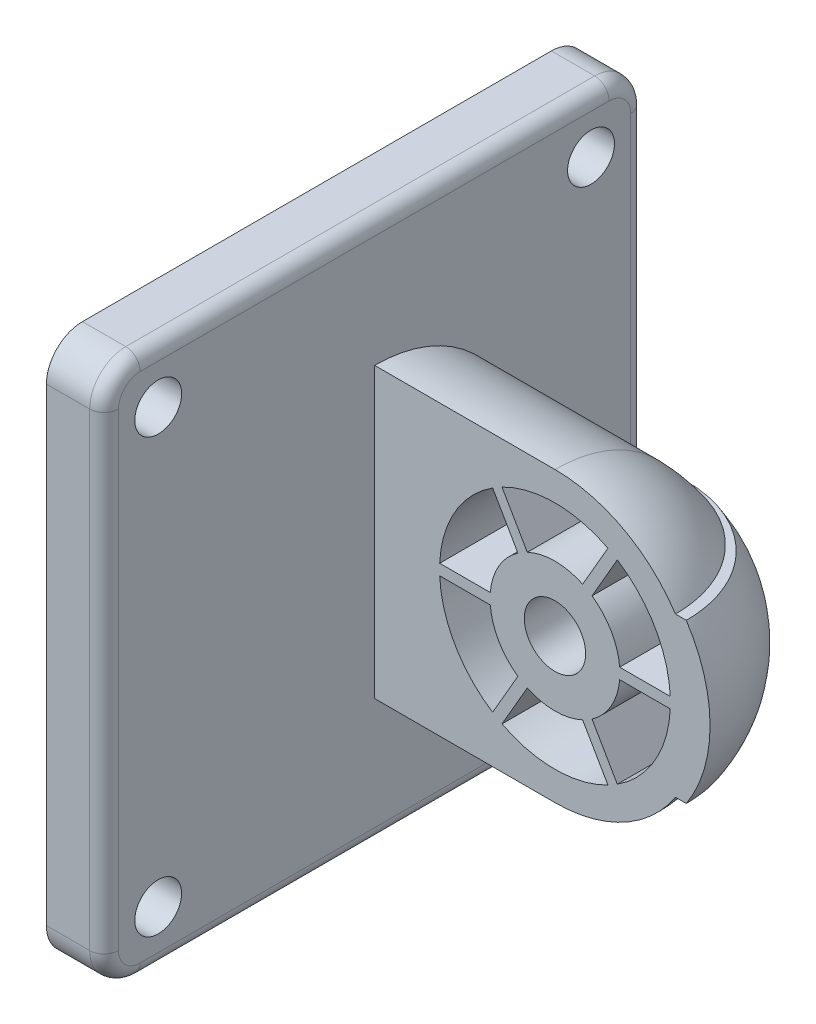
ISO-10303-21;
HEADER;
FILE_DESCRIPTION(('STEP AP214'),'2;1');
FILE_NAME('part.step','',(''),(''),'','','');
FILE_SCHEMA(('AUTOMOTIVE_DESIGN { 1 0 10303 214 1 1 1 1 }'));
ENDSEC;
DATA;
#1=APPLICATION_CONTEXT('core data for automotive mechanical design processes');
#2=APPLICATION_PROTOCOL_DEFINITION('international standard','automotive_design',2000,#1);
#3=PRODUCT_CONTEXT('',#1,'mechanical');
#4=PRODUCT('Part','Part','',(#3));
#5=PRODUCT_RELATED_PRODUCT_CATEGORY('part','',(#4));
#6=PRODUCT_DEFINITION_FORMATION('','',#4);
#7=PRODUCT_DEFINITION_CONTEXT('part definition',#1,'design');
#8=PRODUCT_DEFINITION('design','',#6,#7);
#9=PRODUCT_DEFINITION_SHAPE('','',#8);
#10=(LENGTH_UNIT() NAMED_UNIT(*) SI_UNIT(.MILLI.,.METRE.));
#11=(NAMED_UNIT(*) PLANE_ANGLE_UNIT() SI_UNIT($,.RADIAN.));
#12=(NAMED_UNIT(*) SI_UNIT($,.STERADIAN.) SOLID_ANGLE_UNIT());
#13=UNCERTAINTY_MEASURE_WITH_UNIT(LENGTH_MEASURE(1.E-05),#10,'distance_accuracy_value','');
#14=(GEOMETRIC_REPRESENTATION_CONTEXT(3) GLOBAL_UNCERTAINTY_ASSIGNED_CONTEXT((#13)) GLOBAL_UNIT_ASSIGNED_CONTEXT((#10,
#11,#12)) REPRESENTATION_CONTEXT('',''));
#15=CARTESIAN_POINT('',(0.,0.,0.));
#16=DIRECTION('',(0.,0.,1.));
#17=DIRECTION('',(1.,0.,0.));
#18=AXIS2_PLACEMENT_3D('',#15,#16,#17);
#19=CARTESIAN_POINT('',(54.5,0.,0.));
#20=DIRECTION('',(-1.,0.,0.));
#21=DIRECTION('',(0.,0.,1.));
#22=AXIS2_PLACEMENT_3D('',#19,#20,#21);
#23=CYLINDRICAL_SURFACE('',#22,20.);
#24=DIRECTION('',(-1.,0.,0.));
#25=VECTOR('',#24,1.);
#26=CARTESIAN_POINT('',(54.5,6.75,-18.8265105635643));
#27=LINE('',#26,#25);
#28=CARTESIAN_POINT('',(29.1028856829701,6.75,-18.8265105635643));
#29=VERTEX_POINT('',#28);
#30=CARTESIAN_POINT('',(34.5,6.75,-18.8265105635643));
#31=VERTEX_POINT('',#30);
#32=EDGE_CURVE('E593',#29,#31,#27,.F.);
#33=ORIENTED_EDGE('',*,*,#32,.F.);
#34=CARTESIAN_POINT('',(25.20577136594,0.,0.));
#35=DIRECTION('',(-0.866025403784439,0.5,0.));
#36=DIRECTION('',(-0.5,-0.866025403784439,0.));
#37=AXIS2_PLACEMENT_3D('',#34,#35,#36);
#38=ELLIPSE('',#37,23.0940107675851,20.);
#39=CARTESIAN_POINT('',(25.20577136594,0.,-20.));
#40=VERTEX_POINT('',#39);
#41=EDGE_CURVE('E9',#40,#29,#38,.F.);
#42=ORIENTED_EDGE('',*,*,#41,.F.);
#43=CARTESIAN_POINT('',(25.20577136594,0.,0.));
#44=DIRECTION('',(-0.866025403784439,-0.5,0.));
#45=DIRECTION('',(-0.5,0.866025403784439,0.));
#46=AXIS2_PLACEMENT_3D('',#43,#44,#45);
#47=ELLIPSE('',#46,23.0940107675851,20.);
#48=CARTESIAN_POINT('',(29.1028856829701,-6.75,-18.8265105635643));
#49=VERTEX_POINT('',#48);
#50=EDGE_CURVE('E21',#49,#40,#47,.F.);
#51=ORIENTED_EDGE('',*,*,#50,.F.);
#52=DIRECTION('',(-1.,0.,0.));
#53=VECTOR('',#52,1.);
#54=CARTESIAN_POINT('',(54.5,-6.75,-18.8265105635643));
#55=LINE('',#54,#53);
#56=CARTESIAN_POINT('',(34.5,-6.75,-18.8265105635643));
#57=VERTEX_POINT('',#56);
#58=EDGE_CURVE('E591',#57,#49,#55,.T.);
#59=ORIENTED_EDGE('',*,*,#58,.F.);
#60=CARTESIAN_POINT('',(34.5,0.,0.));
#61=DIRECTION('',(-1.,0.,0.));
#62=DIRECTION('',(0.,0.,1.));
#63=AXIS2_PLACEMENT_3D('',#60,#61,#62);
#64=CIRCLE('',#63,20.);
#65=CARTESIAN_POINT('',(34.5,-11.,-16.7032930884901));
#66=VERTEX_POINT('',#65);
#67=EDGE_CURVE('E790',#57,#66,#64,.T.);
#68=ORIENTED_EDGE('',*,*,#67,.T.);
#69=DIRECTION('',(-1.,0.,0.));
#70=VECTOR('',#69,1.);
#71=CARTESIAN_POINT('',(54.5,-11.,-16.7032930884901));
#72=LINE('',#71,#70);
#73=CARTESIAN_POINT('',(33.,-11.,-16.7032930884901));
#74=VERTEX_POINT('',#73);
#75=EDGE_CURVE('E773',#74,#66,#72,.F.);
#76=ORIENTED_EDGE('',*,*,#75,.F.);
#77=CARTESIAN_POINT('',(33.,0.,0.));
#78=DIRECTION('',(-1.,0.,0.));
#79=DIRECTION('',(0.,0.,1.));
#80=AXIS2_PLACEMENT_3D('',#77,#78,#79);
#81=CIRCLE('',#80,20.);
#82=CARTESIAN_POINT('',(33.,-20.,0.));
#83=VERTEX_POINT('',#82);
#84=EDGE_CURVE('E610',#74,#83,#81,.T.);
#85=ORIENTED_EDGE('',*,*,#84,.T.);
#86=DIRECTION('',(1.,0.,0.));
#87=VECTOR('',#86,1.);
#88=CARTESIAN_POINT('',(8.00000000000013,-20.,0.));
#89=LINE('',#88,#87);
#90=CARTESIAN_POINT('',(8.00000000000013,-20.,0.));
#91=VERTEX_POINT('',#90);
#92=EDGE_CURVE('E598',#91,#83,#89,.T.);
#93=ORIENTED_EDGE('',*,*,#92,.F.);
#94=CARTESIAN_POINT('',(8.00000000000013,0.,0.));
#95=DIRECTION('',(-1.,0.,0.));
#96=DIRECTION('',(0.,0.,1.));
#97=AXIS2_PLACEMENT_3D('',#94,#95,#96);
#98=CIRCLE('',#97,20.);
#99=CARTESIAN_POINT('',(8.,20.,1.37754248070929E-13));
#100=VERTEX_POINT('',#99);
#101=EDGE_CURVE('E614',#100,#91,#98,.T.);
#102=ORIENTED_EDGE('',*,*,#101,.F.);
#103=DIRECTION('',(1.,0.,0.));
#104=VECTOR('',#103,1.);
#105=CARTESIAN_POINT('',(8.00000000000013,20.,1.39659253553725E-13));
#106=LINE('',#105,#104);
#107=CARTESIAN_POINT('',(33.,20.,1.39659253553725E-13));
#108=VERTEX_POINT('',#107);
#109=EDGE_CURVE('E604',#100,#108,#106,.T.);
#110=ORIENTED_EDGE('',*,*,#109,.T.);
#111=CARTESIAN_POINT('',(33.,11.,-16.70329308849));
#112=VERTEX_POINT('',#111);
#113=EDGE_CURVE('E611',#108,#112,#81,.T.);
#114=ORIENTED_EDGE('',*,*,#113,.T.);
#115=DIRECTION('',(-1.,0.,0.));
#116=VECTOR('',#115,1.);
#117=CARTESIAN_POINT('',(54.5,11.,-16.7032930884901));
#118=LINE('',#117,#116);
#119=CARTESIAN_POINT('',(34.5,11.,-16.7032930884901));
#120=VERTEX_POINT('',#119);
#121=EDGE_CURVE('E781',#120,#112,#118,.T.);
#122=ORIENTED_EDGE('',*,*,#121,.F.);
#123=EDGE_CURVE('E791',#120,#31,#64,.T.);
#124=ORIENTED_EDGE('',*,*,#123,.T.);
#125=EDGE_LOOP('',(#33,#42,#51,#59,#68,#76,#85,#93,#102,#110,#114,#122,#124));
#126=FACE_BOUND('',#125,.T.);
#127=ADVANCED_FACE('F14',(#126),#23,.T.);
#128=CARTESIAN_POINT('',(34.5,0.,0.));
#129=DIRECTION('',(-1.,0.,0.));
#130=DIRECTION('',(0.,1.,0.));
#131=AXIS2_PLACEMENT_3D('',#128,#129,#130);
#132=SPHERICAL_SURFACE('',#131,20.);
#133=CARTESIAN_POINT('',(34.5,6.75,0.));
#134=DIRECTION('',(0.,1.,0.));
#135=DIRECTION('',(0.,0.,1.));
#136=AXIS2_PLACEMENT_3D('',#133,#134,#135);
#137=CIRCLE('',#136,18.8265105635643);
#138=CARTESIAN_POINT('',(36.8971143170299,6.75,-18.6732788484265));
#139=VERTEX_POINT('',#138);
#140=EDGE_CURVE('E809',#31,#139,#137,.F.);
#141=ORIENTED_EDGE('',*,*,#140,.F.);
#142=ORIENTED_EDGE('',*,*,#123,.F.);
#143=CARTESIAN_POINT('',(34.5,11.,0.));
#144=DIRECTION('',(0.,-1.,0.));
#145=DIRECTION('',(0.,0.,-1.));
#146=AXIS2_PLACEMENT_3D('',#143,#144,#145);
#147=CIRCLE('',#146,16.7032930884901);
#148=CARTESIAN_POINT('',(51.2032930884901,11.,0.));
#149=VERTEX_POINT('',#148);
#150=EDGE_CURVE('E779',#149,#120,#147,.F.);
#151=ORIENTED_EDGE('',*,*,#150,.F.);
#152=CARTESIAN_POINT('',(34.5,0.,0.));
#153=DIRECTION('',(0.,0.,-1.));
#154=DIRECTION('',(1.,0.,0.));
#155=AXIS2_PLACEMENT_3D('',#152,#153,#154);
#156=CIRCLE('',#155,20.);
#157=CARTESIAN_POINT('',(51.2032930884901,-11.,0.));
#158=VERTEX_POINT('',#157);
#159=EDGE_CURVE('E787',#149,#158,#156,.T.);
#160=ORIENTED_EDGE('',*,*,#159,.T.);
#161=CARTESIAN_POINT('',(34.5,-11.,0.));
#162=DIRECTION('',(0.,1.,0.));
#163=DIRECTION('',(0.,0.,1.));
#164=AXIS2_PLACEMENT_3D('',#161,#162,#163);
#165=CIRCLE('',#164,16.70329308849);
#166=EDGE_CURVE('E769',#66,#158,#165,.F.);
#167=ORIENTED_EDGE('',*,*,#166,.F.);
#168=ORIENTED_EDGE('',*,*,#67,.F.);
#169=CARTESIAN_POINT('',(34.5,-6.75,0.));
#170=DIRECTION('',(0.,-1.,0.));
#171=DIRECTION('',(1.,0.,0.));
#172=AXIS2_PLACEMENT_3D('',#169,#170,#171);
#173=CIRCLE('',#172,18.8265105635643);
#174=CARTESIAN_POINT('',(36.89711431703,-6.75,-18.6732788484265));
#175=VERTEX_POINT('',#174);
#176=EDGE_CURVE('E800',#175,#57,#173,.F.);
#177=ORIENTED_EDGE('',*,*,#176,.F.);
#178=CARTESIAN_POINT('',(39.2206714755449,-2.72548094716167,0.));
#179=DIRECTION('',(0.866025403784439,-0.5,0.));
#180=DIRECTION('',(0.5,0.866025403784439,0.));
#181=AXIS2_PLACEMENT_3D('',#178,#179,#180);
#182=CIRCLE('',#181,19.242843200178);
#183=CARTESIAN_POINT('',(40.79422863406,0.,-18.9837479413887));
#184=VERTEX_POINT('',#183);
#185=EDGE_CURVE('E804',#184,#175,#182,.F.);
#186=ORIENTED_EDGE('',*,*,#185,.F.);
#187=CARTESIAN_POINT('',(39.2206714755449,2.72548094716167,0.));
#188=DIRECTION('',(0.866025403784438,0.5,0.));
#189=DIRECTION('',(-0.5,0.866025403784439,0.));
#190=AXIS2_PLACEMENT_3D('',#187,#188,#189);
#191=CIRCLE('',#190,19.242843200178);
#192=EDGE_CURVE('E807',#139,#184,#191,.F.);
#193=ORIENTED_EDGE('',*,*,#192,.F.);
#194=EDGE_LOOP('',(#141,#142,#151,#160,#167,#168,#177,#186,#193));
#195=FACE_BOUND('',#194,.T.);
#196=ADVANCED_FACE('F832',(#195),#132,.T.);
#197=CARTESIAN_POINT('',(33.,0.,0.));
#198=DIRECTION('',(0.,0.,-1.));
#199=DIRECTION('',(1.,0.,0.));
#200=AXIS2_PLACEMENT_3D('',#197,#198,#199);
#201=PLANE('',#200);
#202=DIRECTION('',(1.,0.,0.));
#203=VECTOR('',#202,1.);
#204=CARTESIAN_POINT('',(24.031304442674,0.749999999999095,0.));
#205=LINE('',#204,#203);
#206=CARTESIAN_POINT('',(17.0175877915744,0.749999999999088,0.));
#207=VERTEX_POINT('',#206);
#208=CARTESIAN_POINT('',(24.031304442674,0.749999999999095,0.));
#209=VERTEX_POINT('',#208);
#210=EDGE_CURVE('E451',#207,#209,#205,.T.);
#211=ORIENTED_EDGE('',*,*,#210,.F.);
#212=CARTESIAN_POINT('',(33.,0.,0.));
#213=DIRECTION('',(0.,0.,1.));
#214=DIRECTION('',(1.,0.,0.));
#215=AXIS2_PLACEMENT_3D('',#212,#213,#214);
#216=CIRCLE('',#215,16.0000000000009);
#217=CARTESIAN_POINT('',(24.3592748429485,13.4661749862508,0.));
#218=VERTEX_POINT('',#217);
#219=EDGE_CURVE('E28',#218,#207,#216,.T.);
#220=ORIENTED_EDGE('',*,*,#219,.F.);
#221=DIRECTION('',(-0.5,0.866025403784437,0.));
#222=VECTOR('',#221,1.);
#223=CARTESIAN_POINT('',(27.8661331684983,7.39211819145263,0.));
#224=LINE('',#223,#222);
#225=CARTESIAN_POINT('',(27.8661331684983,7.39211819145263,0.));
#226=VERTEX_POINT('',#225);
#227=EDGE_CURVE('E440',#226,#218,#224,.T.);
#228=ORIENTED_EDGE('',*,*,#227,.F.);
#229=CARTESIAN_POINT('',(33.,0.,0.));
#230=DIRECTION('',(0.,0.,-1.));
#231=DIRECTION('',(1.,0.,0.));
#232=AXIS2_PLACEMENT_3D('',#229,#230,#231);
#233=CIRCLE('',#232,8.99999999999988);
#234=EDGE_CURVE('E454',#209,#226,#233,.T.);
#235=ORIENTED_EDGE('',*,*,#234,.F.);
#236=EDGE_LOOP('',(#211,#220,#228,#235));
#237=FACE_BOUND('',#236,.T.);
#238=DIRECTION('',(0.5,0.866025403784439,0.));
#239=VECTOR('',#238,1.);
#240=CARTESIAN_POINT('',(27.8661331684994,-7.3921181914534,0.));
#241=LINE('',#240,#239);
#242=CARTESIAN_POINT('',(24.3592748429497,-13.4661749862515,0.));
#243=VERTEX_POINT('',#242);
#244=CARTESIAN_POINT('',(27.8661331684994,-7.3921181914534,0.));
#245=VERTEX_POINT('',#244);
#246=EDGE_CURVE('E419',#243,#245,#241,.T.);
#247=ORIENTED_EDGE('',*,*,#246,.F.);
#248=CARTESIAN_POINT('',(33.,0.,0.));
#249=DIRECTION('',(0.,0.,1.));
#250=DIRECTION('',(1.,0.,0.));
#251=AXIS2_PLACEMENT_3D('',#248,#249,#250);
#252=CIRCLE('',#251,16.0000000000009);
#253=CARTESIAN_POINT('',(17.0175877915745,-0.750000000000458,0.));
#254=VERTEX_POINT('',#253);
#255=EDGE_CURVE('E36',#254,#243,#252,.T.);
#256=ORIENTED_EDGE('',*,*,#255,.F.);
#257=DIRECTION('',(-1.,0.,0.));
#258=VECTOR('',#257,1.);
#259=CARTESIAN_POINT('',(24.0313044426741,-0.750000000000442,0.));
#260=LINE('',#259,#258);
#261=CARTESIAN_POINT('',(24.0313044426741,-0.750000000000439,0.));
#262=VERTEX_POINT('',#261);
#263=EDGE_CURVE('E408',#262,#254,#260,.T.);
#264=ORIENTED_EDGE('',*,*,#263,.F.);
#265=CARTESIAN_POINT('',(33.,0.,0.));
#266=DIRECTION('',(0.,0.,-1.));
#267=DIRECTION('',(1.,0.,0.));
#268=AXIS2_PLACEMENT_3D('',#265,#266,#267);
#269=CIRCLE('',#268,8.99999999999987);
#270=EDGE_CURVE('E423',#245,#262,#269,.T.);
#271=ORIENTED_EDGE('',*,*,#270,.F.);
#272=EDGE_LOOP('',(#247,#256,#264,#271));
#273=FACE_BOUND('',#272,.T.);
#274=DIRECTION('',(-1.,0.,0.));
#275=VECTOR('',#274,1.);
#276=CARTESIAN_POINT('',(41.968695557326,-0.749999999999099,0.));
#277=LINE('',#276,#275);
#278=CARTESIAN_POINT('',(48.9824122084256,-0.749999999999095,0.));
#279=VERTEX_POINT('',#278);
#280=CARTESIAN_POINT('',(41.968695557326,-0.749999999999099,0.));
#281=VERTEX_POINT('',#280);
#282=EDGE_CURVE('E512',#279,#281,#277,.T.);
#283=ORIENTED_EDGE('',*,*,#282,.F.);
#284=CARTESIAN_POINT('',(33.,0.,0.));
#285=DIRECTION('',(0.,0.,1.));
#286=DIRECTION('',(1.,0.,0.));
#287=AXIS2_PLACEMENT_3D('',#284,#285,#286);
#288=CIRCLE('',#287,16.000000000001);
#289=CARTESIAN_POINT('',(41.6407251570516,-13.4661749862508,0.));
#290=VERTEX_POINT('',#289);
#291=EDGE_CURVE('E490',#290,#279,#288,.T.);
#292=ORIENTED_EDGE('',*,*,#291,.F.);
#293=DIRECTION('',(0.500000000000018,-0.866025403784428,0.));
#294=VECTOR('',#293,1.);
#295=CARTESIAN_POINT('',(38.1338668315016,-7.39211819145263,0.));
#296=LINE('',#295,#294);
#297=CARTESIAN_POINT('',(38.1338668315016,-7.39211819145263,0.));
#298=VERTEX_POINT('',#297);
#299=EDGE_CURVE('E501',#298,#290,#296,.T.);
#300=ORIENTED_EDGE('',*,*,#299,.F.);
#301=CARTESIAN_POINT('',(33.,0.,0.));
#302=DIRECTION('',(0.,0.,-1.));
#303=DIRECTION('',(1.,0.,0.));
#304=AXIS2_PLACEMENT_3D('',#301,#302,#303);
#305=CIRCLE('',#304,8.99999999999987);
#306=EDGE_CURVE('E515',#281,#298,#305,.T.);
#307=ORIENTED_EDGE('',*,*,#306,.F.);
#308=EDGE_LOOP('',(#283,#292,#300,#307));
#309=FACE_BOUND('',#308,.T.);
#310=DIRECTION('',(-0.5,0.866025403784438,0.));
#311=VECTOR('',#310,1.);
#312=CARTESIAN_POINT('',(36.8348287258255,-8.1421181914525,0.));
#313=LINE('',#312,#311);
#314=CARTESIAN_POINT('',(40.3416870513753,-14.2161749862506,0.));
#315=VERTEX_POINT('',#314);
#316=CARTESIAN_POINT('',(36.8348287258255,-8.1421181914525,0.));
#317=VERTEX_POINT('',#316);
#318=EDGE_CURVE('E480',#315,#317,#313,.T.);
#319=ORIENTED_EDGE('',*,*,#318,.F.);
#320=CARTESIAN_POINT('',(33.,0.,0.));
#321=DIRECTION('',(0.,0.,1.));
#322=DIRECTION('',(1.,0.,0.));
#323=AXIS2_PLACEMENT_3D('',#320,#321,#322);
#324=CIRCLE('',#323,16.0000000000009);
#325=CARTESIAN_POINT('',(25.658312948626,-14.2161749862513,0.));
#326=VERTEX_POINT('',#325);
#327=EDGE_CURVE('E430',#326,#315,#324,.T.);
#328=ORIENTED_EDGE('',*,*,#327,.F.);
#329=DIRECTION('',(-0.5,-0.86602540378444,0.));
#330=VECTOR('',#329,1.);
#331=CARTESIAN_POINT('',(29.1651712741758,-8.14211819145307,0.));
#332=LINE('',#331,#330);
#333=CARTESIAN_POINT('',(29.1651712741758,-8.14211819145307,0.));
#334=VERTEX_POINT('',#333);
#335=EDGE_CURVE('E469',#334,#326,#332,.T.);
#336=ORIENTED_EDGE('',*,*,#335,.F.);
#337=CARTESIAN_POINT('',(33.,0.,0.));
#338=DIRECTION('',(0.,0.,-1.));
#339=DIRECTION('',(1.,0.,0.));
#340=AXIS2_PLACEMENT_3D('',#337,#338,#339);
#341=CIRCLE('',#340,8.99999999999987);
#342=EDGE_CURVE('E483',#317,#334,#341,.T.);
#343=ORIENTED_EDGE('',*,*,#342,.F.);
#344=EDGE_LOOP('',(#319,#328,#336,#343));
#345=FACE_BOUND('',#344,.T.);
#346=DIRECTION('',(0.5,-0.866025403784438,0.));
#347=VECTOR('',#346,1.);
#348=CARTESIAN_POINT('',(29.1651712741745,8.14211819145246,0.));
#349=LINE('',#348,#347);
#350=CARTESIAN_POINT('',(25.6583129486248,14.2161749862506,0.));
#351=VERTEX_POINT('',#350);
#352=CARTESIAN_POINT('',(29.1651712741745,8.14211819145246,0.));
#353=VERTEX_POINT('',#352);
#354=EDGE_CURVE('E388',#351,#353,#349,.T.);
#355=ORIENTED_EDGE('',*,*,#354,.F.);
#356=CARTESIAN_POINT('',(33.,0.,0.));
#357=DIRECTION('',(0.,0.,1.));
#358=DIRECTION('',(1.,0.,0.));
#359=AXIS2_PLACEMENT_3D('',#356,#357,#358);
#360=CIRCLE('',#359,16.0000000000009);
#361=CARTESIAN_POINT('',(40.341687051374,14.2161749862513,0.));
#362=VERTEX_POINT('',#361);
#363=EDGE_CURVE('E372',#362,#351,#360,.T.);
#364=ORIENTED_EDGE('',*,*,#363,.F.);
#365=DIRECTION('',(0.5,0.86602540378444,0.));
#366=VECTOR('',#365,1.);
#367=CARTESIAN_POINT('',(36.8348287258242,8.14211819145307,0.));
#368=LINE('',#367,#366);
#369=CARTESIAN_POINT('',(36.8348287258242,8.14211819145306,0.));
#370=VERTEX_POINT('',#369);
#371=EDGE_CURVE('E377',#370,#362,#368,.T.);
#372=ORIENTED_EDGE('',*,*,#371,.F.);
#373=CARTESIAN_POINT('',(33.,0.,0.));
#374=DIRECTION('',(0.,0.,-1.));
#375=DIRECTION('',(1.,0.,0.));
#376=AXIS2_PLACEMENT_3D('',#373,#374,#375);
#377=CIRCLE('',#376,8.99999999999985);
#378=EDGE_CURVE('E391',#353,#370,#377,.T.);
#379=ORIENTED_EDGE('',*,*,#378,.F.);
#380=EDGE_LOOP('',(#355,#364,#372,#379));
#381=FACE_BOUND('',#380,.T.);
#382=DIRECTION('',(-0.5,-0.866025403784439,0.));
#383=VECTOR('',#382,1.);
#384=CARTESIAN_POINT('',(38.1338668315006,7.3921181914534,0.));
#385=LINE('',#384,#383);
#386=CARTESIAN_POINT('',(41.6407251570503,13.4661749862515,0.));
#387=VERTEX_POINT('',#386);
#388=CARTESIAN_POINT('',(38.1338668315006,7.3921181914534,0.));
#389=VERTEX_POINT('',#388);
#390=EDGE_CURVE('E544',#387,#389,#385,.T.);
#391=ORIENTED_EDGE('',*,*,#390,.F.);
#392=CARTESIAN_POINT('',(33.,0.,0.));
#393=DIRECTION('',(0.,0.,1.));
#394=DIRECTION('',(1.,0.,0.));
#395=AXIS2_PLACEMENT_3D('',#392,#393,#394);
#396=CIRCLE('',#395,16.0000000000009);
#397=CARTESIAN_POINT('',(48.9824122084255,0.750000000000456,0.));
#398=VERTEX_POINT('',#397);
#399=EDGE_CURVE('E522',#398,#387,#396,.T.);
#400=ORIENTED_EDGE('',*,*,#399,.F.);
#401=DIRECTION('',(1.,0.,0.));
#402=VECTOR('',#401,1.);
#403=CARTESIAN_POINT('',(41.9686955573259,0.750000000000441,0.));
#404=LINE('',#403,#402);
#405=CARTESIAN_POINT('',(41.9686955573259,0.750000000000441,0.));
#406=VERTEX_POINT('',#405);
#407=EDGE_CURVE('E533',#406,#398,#404,.T.);
#408=ORIENTED_EDGE('',*,*,#407,.F.);
#409=CARTESIAN_POINT('',(33.,0.,0.));
#410=DIRECTION('',(0.,0.,-1.));
#411=DIRECTION('',(1.,0.,0.));
#412=AXIS2_PLACEMENT_3D('',#409,#410,#411);
#413=CIRCLE('',#412,8.99999999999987);
#414=EDGE_CURVE('E547',#389,#406,#413,.T.);
#415=ORIENTED_EDGE('',*,*,#414,.F.);
#416=EDGE_LOOP('',(#391,#400,#408,#415));
#417=FACE_BOUND('',#416,.T.);
#418=CARTESIAN_POINT('',(33.,0.,0.));
#419=DIRECTION('',(0.,0.,1.));
#420=DIRECTION('',(1.,0.,0.));
#421=AXIS2_PLACEMENT_3D('',#418,#419,#420);
#422=CIRCLE('',#421,4.25);
#423=CARTESIAN_POINT('',(37.25,0.,0.));
#424=VERTEX_POINT('',#423);
#425=EDGE_CURVE('E595',#424,#424,#422,.T.);
#426=ORIENTED_EDGE('',*,*,#425,.F.);
#427=EDGE_LOOP('',(#426));
#428=FACE_BOUND('',#427,.T.);
#429=ORIENTED_EDGE('',*,*,#159,.F.);
#430=DIRECTION('',(-1.,0.,0.));
#431=VECTOR('',#430,1.);
#432=CARTESIAN_POINT('',(33.,11.,0.));
#433=LINE('',#432,#431);
#434=CARTESIAN_POINT('',(49.7032930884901,11.,0.));
#435=VERTEX_POINT('',#434);
#436=EDGE_CURVE('E797',#149,#435,#433,.T.);
#437=ORIENTED_EDGE('',*,*,#436,.T.);
#438=CARTESIAN_POINT('',(33.,0.,0.));
#439=DIRECTION('',(0.,0.,-1.));
#440=DIRECTION('',(1.,0.,0.));
#441=AXIS2_PLACEMENT_3D('',#438,#439,#440);
#442=CIRCLE('',#441,20.);
#443=EDGE_CURVE('E608',#108,#435,#442,.T.);
#444=ORIENTED_EDGE('',*,*,#443,.F.);
#445=ORIENTED_EDGE('',*,*,#109,.F.);
#446=DIRECTION('',(0.,1.,0.));
#447=VECTOR('',#446,1.);
#448=CARTESIAN_POINT('',(8.,0.,0.));
#449=LINE('',#448,#447);
#450=EDGE_CURVE('E601',#91,#100,#449,.T.);
#451=ORIENTED_EDGE('',*,*,#450,.F.);
#452=ORIENTED_EDGE('',*,*,#92,.T.);
#453=CARTESIAN_POINT('',(49.7032930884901,-11.,0.));
#454=VERTEX_POINT('',#453);
#455=EDGE_CURVE('E607',#454,#83,#442,.T.);
#456=ORIENTED_EDGE('',*,*,#455,.F.);
#457=DIRECTION('',(1.,0.,0.));
#458=VECTOR('',#457,1.);
#459=CARTESIAN_POINT('',(33.,-11.,0.));
#460=LINE('',#459,#458);
#461=EDGE_CURVE('E794',#454,#158,#460,.T.);
#462=ORIENTED_EDGE('',*,*,#461,.T.);
#463=EDGE_LOOP('',(#429,#437,#444,#445,#451,#452,#456,#462));
#464=FACE_BOUND('',#463,.T.);
#465=ADVANCED_FACE('F859',(#237,#273,#309,#345,#381,#417,#428,#464),#201,.F.);
#466=CARTESIAN_POINT('',(26.7611252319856,-11.,-37.5));
#467=DIRECTION('',(0.,1.,0.));
#468=DIRECTION('',(0.,0.,1.));
#469=AXIS2_PLACEMENT_3D('',#466,#467,#468);
#470=PLANE('',#469);
#471=CARTESIAN_POINT('',(33.,-11.,0.));
#472=DIRECTION('',(0.,1.,0.));
#473=DIRECTION('',(0.,0.,1.));
#474=AXIS2_PLACEMENT_3D('',#471,#472,#473);
#475=CIRCLE('',#474,16.70329308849);
#476=EDGE_CURVE('E776',#454,#74,#475,.T.);
#477=ORIENTED_EDGE('',*,*,#476,.T.);
#478=ORIENTED_EDGE('',*,*,#75,.T.);
#479=ORIENTED_EDGE('',*,*,#166,.T.);
#480=ORIENTED_EDGE('',*,*,#461,.F.);
#481=EDGE_LOOP('',(#477,#478,#479,#480));
#482=FACE_BOUND('',#481,.T.);
#483=ADVANCED_FACE('F856',(#482),#470,.F.);
#484=CARTESIAN_POINT('',(26.7611252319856,11.,-37.5));
#485=DIRECTION('',(0.,-1.,0.));
#486=DIRECTION('',(0.,0.,-1.));
#487=AXIS2_PLACEMENT_3D('',#484,#485,#486);
#488=PLANE('',#487);
#489=CARTESIAN_POINT('',(33.,11.,0.));
#490=DIRECTION('',(0.,-1.,0.));
#491=DIRECTION('',(0.,0.,-1.));
#492=AXIS2_PLACEMENT_3D('',#489,#490,#491);
#493=CIRCLE('',#492,16.7032930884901);
#494=EDGE_CURVE('E784',#112,#435,#493,.T.);
#495=ORIENTED_EDGE('',*,*,#494,.T.);
#496=ORIENTED_EDGE('',*,*,#436,.F.);
#497=ORIENTED_EDGE('',*,*,#150,.T.);
#498=ORIENTED_EDGE('',*,*,#121,.T.);
#499=EDGE_LOOP('',(#495,#496,#497,#498));
#500=FACE_BOUND('',#499,.T.);
#501=ADVANCED_FACE('F871',(#500),#488,.F.);
#502=CARTESIAN_POINT('',(33.,0.,0.));
#503=DIRECTION('',(-1.,0.,0.));
#504=DIRECTION('',(0.,1.,0.));
#505=AXIS2_PLACEMENT_3D('',#502,#503,#504);
#506=SPHERICAL_SURFACE('',#505,20.);
#507=ORIENTED_EDGE('',*,*,#494,.F.);
#508=ORIENTED_EDGE('',*,*,#113,.F.);
#509=ORIENTED_EDGE('',*,*,#443,.T.);
#510=EDGE_LOOP('',(#507,#508,#509));
#511=FACE_BOUND('',#510,.T.);
#512=ADVANCED_FACE('F872',(#511),#506,.T.);
#513=ORIENTED_EDGE('',*,*,#476,.F.);
#514=ORIENTED_EDGE('',*,*,#455,.T.);
#515=ORIENTED_EDGE('',*,*,#84,.F.);
#516=EDGE_LOOP('',(#513,#514,#515));
#517=FACE_BOUND('',#516,.T.);
#518=ADVANCED_FACE('F863',(#517),#506,.T.);
#519=CARTESIAN_POINT('',(8.00000000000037,-35.5000000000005,35.5));
#520=DIRECTION('',(1.,0.,0.));
#521=DIRECTION('',(0.,0.,-1.));
#522=AXIS2_PLACEMENT_3D('',#519,#520,#521);
#523=PLANE('',#522);
#524=ORIENTED_EDGE('',*,*,#101,.T.);
#525=ORIENTED_EDGE('',*,*,#450,.T.);
#526=EDGE_LOOP('',(#524,#525));
#527=FACE_BOUND('',#526,.T.);
#528=DIRECTION('',(0.,-1.,0.));
#529=VECTOR('',#528,1.);
#530=CARTESIAN_POINT('',(8.00000000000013,32.5000000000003,35.5));
#531=LINE('',#530,#529);
#532=CARTESIAN_POINT('',(8.00000000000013,32.5000000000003,35.5));
#533=VERTEX_POINT('',#532);
#534=CARTESIAN_POINT('',(8.00000000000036,-32.5000000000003,35.5));
#535=VERTEX_POINT('',#534);
#536=EDGE_CURVE('E617',#533,#535,#531,.T.);
#537=ORIENTED_EDGE('',*,*,#536,.T.);
#538=CARTESIAN_POINT('',(8.00000000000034,-32.5000000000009,32.5000000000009));
#539=DIRECTION('',(1.,0.,0.));
#540=DIRECTION('',(0.,1.84741111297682E-13,1.));
#541=AXIS2_PLACEMENT_3D('',#538,#539,#540);
#542=CIRCLE('',#541,2.99999999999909);
#543=CARTESIAN_POINT('',(8.00000000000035,-35.5,32.5000000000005));
#544=VERTEX_POINT('',#543);
#545=EDGE_CURVE('E620',#535,#544,#542,.T.);
#546=ORIENTED_EDGE('',*,*,#545,.T.);
#547=DIRECTION('',(0.,0.,-1.));
#548=VECTOR('',#547,1.);
#549=CARTESIAN_POINT('',(8.00000000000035,-35.5,32.5000000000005));
#550=LINE('',#549,#548);
#551=CARTESIAN_POINT('',(7.9999999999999,-35.5,-32.5));
#552=VERTEX_POINT('',#551);
#553=EDGE_CURVE('E625',#544,#552,#550,.T.);
#554=ORIENTED_EDGE('',*,*,#553,.T.);
#555=CARTESIAN_POINT('',(7.99999999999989,-32.5000000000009,-32.5000000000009));
#556=DIRECTION('',(1.,0.,0.));
#557=DIRECTION('',(0.,-1.,3.05533376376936E-13));
#558=AXIS2_PLACEMENT_3D('',#555,#556,#557);
#559=CIRCLE('',#558,2.99999999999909);
#560=CARTESIAN_POINT('',(7.99999999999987,-32.5000000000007,-35.5));
#561=VERTEX_POINT('',#560);
#562=EDGE_CURVE('E630',#552,#561,#559,.T.);
#563=ORIENTED_EDGE('',*,*,#562,.T.);
#564=DIRECTION('',(0.,1.,0.));
#565=VECTOR('',#564,1.);
#566=CARTESIAN_POINT('',(7.99999999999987,-32.5000000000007,-35.5));
#567=LINE('',#566,#565);
#568=CARTESIAN_POINT('',(7.99999999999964,32.5,-35.5));
#569=VERTEX_POINT('',#568);
#570=EDGE_CURVE('E635',#561,#569,#567,.T.);
#571=ORIENTED_EDGE('',*,*,#570,.T.);
#572=CARTESIAN_POINT('',(7.99999999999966,32.5000000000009,-32.5000000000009));
#573=DIRECTION('',(1.,0.,0.));
#574=DIRECTION('',(0.,-2.74743191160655E-13,-1.));
#575=AXIS2_PLACEMENT_3D('',#572,#573,#574);
#576=CIRCLE('',#575,2.99999999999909);
#577=CARTESIAN_POINT('',(7.99999999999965,35.5,-32.5000000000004));
#578=VERTEX_POINT('',#577);
#579=EDGE_CURVE('E640',#569,#578,#576,.T.);
#580=ORIENTED_EDGE('',*,*,#579,.T.);
#581=DIRECTION('',(0.,0.,1.));
#582=VECTOR('',#581,1.);
#583=CARTESIAN_POINT('',(7.99999999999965,35.5,-32.5000000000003));
#584=LINE('',#583,#582);
#585=CARTESIAN_POINT('',(8.0000000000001,35.5,32.5));
#586=VERTEX_POINT('',#585);
#587=EDGE_CURVE('E645',#578,#586,#584,.T.);
#588=ORIENTED_EDGE('',*,*,#587,.T.);
#589=CARTESIAN_POINT('',(8.00000000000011,32.5000000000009,32.5000000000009));
#590=DIRECTION('',(1.,0.,0.));
#591=DIRECTION('',(0.,1.,-3.00796424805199E-13));
#592=AXIS2_PLACEMENT_3D('',#589,#590,#591);
#593=CIRCLE('',#592,2.99999999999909);
#594=EDGE_CURVE('E650',#586,#533,#593,.T.);
#595=ORIENTED_EDGE('',*,*,#594,.T.);
#596=EDGE_LOOP('',(#537,#546,#554,#563,#571,#580,#588,#595));
#597=FACE_BOUND('',#596,.T.);
#598=CARTESIAN_POINT('',(7.9999999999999,-30.,-30.));
#599=DIRECTION('',(-1.,0.,0.));
#600=DIRECTION('',(0.,0.,-1.));
#601=AXIS2_PLACEMENT_3D('',#598,#599,#600);
#602=CIRCLE('',#601,3.25);
#603=CARTESIAN_POINT('',(7.99999999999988,-30.,-33.25));
#604=VERTEX_POINT('',#603);
#605=EDGE_CURVE('E655',#604,#604,#602,.F.);
#606=ORIENTED_EDGE('',*,*,#605,.F.);
#607=EDGE_LOOP('',(#606));
#608=FACE_BOUND('',#607,.T.);
#609=CARTESIAN_POINT('',(7.99999999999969,30.,-30.));
#610=DIRECTION('',(-1.,0.,0.));
#611=DIRECTION('',(0.,0.,-1.));
#612=AXIS2_PLACEMENT_3D('',#609,#610,#611);
#613=CIRCLE('',#612,3.25);
#614=CARTESIAN_POINT('',(7.99999999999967,30.,-33.25));
#615=VERTEX_POINT('',#614);
#616=EDGE_CURVE('E660',#615,#615,#613,.F.);
#617=ORIENTED_EDGE('',*,*,#616,.F.);
#618=EDGE_LOOP('',(#617));
#619=FACE_BOUND('',#618,.T.);
#620=CARTESIAN_POINT('',(8.0000000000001,30.,30.));
#621=DIRECTION('',(-1.,0.,0.));
#622=DIRECTION('',(0.,0.,-1.));
#623=AXIS2_PLACEMENT_3D('',#620,#621,#622);
#624=CIRCLE('',#623,3.25);
#625=CARTESIAN_POINT('',(8.00000000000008,30.,26.75));
#626=VERTEX_POINT('',#625);
#627=EDGE_CURVE('E663',#626,#626,#624,.F.);
#628=ORIENTED_EDGE('',*,*,#627,.F.);
#629=EDGE_LOOP('',(#628));
#630=FACE_BOUND('',#629,.T.);
#631=CARTESIAN_POINT('',(8.00000000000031,-30.,30.));
#632=DIRECTION('',(-1.,0.,0.));
#633=DIRECTION('',(0.,0.,-1.));
#634=AXIS2_PLACEMENT_3D('',#631,#632,#633);
#635=CIRCLE('',#634,3.25);
#636=CARTESIAN_POINT('',(8.00000000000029,-30.,26.75));
#637=VERTEX_POINT('',#636);
#638=EDGE_CURVE('E666',#637,#637,#635,.F.);
#639=ORIENTED_EDGE('',*,*,#638,.F.);
#640=EDGE_LOOP('',(#639));
#641=FACE_BOUND('',#640,.T.);
#642=ADVANCED_FACE('F866',(#527,#597,#608,#619,#630,#641),#523,.T.);
#643=CARTESIAN_POINT('',(0.50000000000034,-32.500000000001,32.500000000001));
#644=DIRECTION('',(1.,0.,0.));
#645=DIRECTION('',(0.,1.8042268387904E-13,1.));
#646=AXIS2_PLACEMENT_3D('',#643,#644,#645);
#647=CYLINDRICAL_SURFACE('',#646,4.99999999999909);
#648=DIRECTION('',(1.,0.,0.));
#649=VECTOR('',#648,1.);
#650=CARTESIAN_POINT('',(0.50000000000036,-37.5,32.5));
#651=LINE('',#650,#649);
#652=CARTESIAN_POINT('',(3.55618312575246E-13,-37.5,32.5));
#653=VERTEX_POINT('',#652);
#654=CARTESIAN_POINT('',(6.00000000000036,-37.5,32.5));
#655=VERTEX_POINT('',#654);
#656=EDGE_CURVE('E669',#653,#655,#651,.T.);
#657=ORIENTED_EDGE('',*,*,#656,.T.);
#658=CARTESIAN_POINT('',(6.00000000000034,-32.5000000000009,32.5000000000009));
#659=DIRECTION('',(-1.,0.,0.));
#660=DIRECTION('',(0.,-1.,-1.35003119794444E-13));
#661=AXIS2_PLACEMENT_3D('',#658,#659,#660);
#662=CIRCLE('',#661,4.99999999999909);
#663=CARTESIAN_POINT('',(6.00000000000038,-32.5,37.5));
#664=VERTEX_POINT('',#663);
#665=EDGE_CURVE('E330',#655,#664,#662,.T.);
#666=ORIENTED_EDGE('',*,*,#665,.T.);
#667=DIRECTION('',(-1.,0.,0.));
#668=VECTOR('',#667,1.);
#669=CARTESIAN_POINT('',(6.00000000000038,-32.5,37.5));
#670=LINE('',#669,#668);
#671=CARTESIAN_POINT('',(3.72965547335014E-13,-32.500000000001,37.5));
#672=VERTEX_POINT('',#671);
#673=EDGE_CURVE('E324',#672,#664,#670,.F.);
#674=ORIENTED_EDGE('',*,*,#673,.F.);
#675=CARTESIAN_POINT('',(3.38271077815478E-13,-32.500000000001,32.500000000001));
#676=DIRECTION('',(-1.,0.,0.));
#677=DIRECTION('',(0.,0.,1.));
#678=AXIS2_PLACEMENT_3D('',#675,#676,#677);
#679=CIRCLE('',#678,4.99999999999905);
#680=EDGE_CURVE('E329',#653,#672,#679,.T.);
#681=ORIENTED_EDGE('',*,*,#680,.F.);
#682=EDGE_LOOP('',(#657,#666,#674,#681));
#683=FACE_BOUND('',#682,.T.);
#684=ADVANCED_FACE('F327',(#683),#647,.T.);
#685=CARTESIAN_POINT('',(0.50000000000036,-37.5,32.5));
#686=DIRECTION('',(0.,-1.,0.));
#687=DIRECTION('',(0.,0.,-1.));
#688=AXIS2_PLACEMENT_3D('',#685,#686,#687);
#689=PLANE('',#688);
#690=DIRECTION('',(1.,0.,0.));
#691=VECTOR('',#690,1.);
#692=CARTESIAN_POINT('',(0.499999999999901,-37.5,-32.5));
#693=LINE('',#692,#691);
#694=CARTESIAN_POINT('',(0.,-37.5,-32.5));
#695=VERTEX_POINT('',#694);
#696=CARTESIAN_POINT('',(5.99999999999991,-37.5,-32.5));
#697=VERTEX_POINT('',#696);
#698=EDGE_CURVE('E334',#695,#697,#693,.T.);
#699=ORIENTED_EDGE('',*,*,#698,.T.);
#700=DIRECTION('',(0.,0.,1.));
#701=VECTOR('',#700,1.);
#702=CARTESIAN_POINT('',(5.99999999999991,-37.5,-32.5));
#703=LINE('',#702,#701);
#704=EDGE_CURVE('E680',#697,#655,#703,.T.);
#705=ORIENTED_EDGE('',*,*,#704,.T.);
#706=ORIENTED_EDGE('',*,*,#656,.F.);
#707=DIRECTION('',(0.,0.,1.));
#708=VECTOR('',#707,1.);
#709=CARTESIAN_POINT('',(0.,-37.5,-32.5));
#710=LINE('',#709,#708);
#711=EDGE_CURVE('E351',#695,#653,#710,.T.);
#712=ORIENTED_EDGE('',*,*,#711,.F.);
#713=EDGE_LOOP('',(#699,#705,#706,#712));
#714=FACE_BOUND('',#713,.T.);
#715=ADVANCED_FACE('F968',(#714),#689,.T.);
#716=CARTESIAN_POINT('',(0.49999999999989,-32.500000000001,-32.5000000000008));
#717=DIRECTION('',(1.,0.,0.));
#718=DIRECTION('',(0.,-1.,1.79350808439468E-13));
#719=AXIS2_PLACEMENT_3D('',#716,#717,#718);
#720=CYLINDRICAL_SURFACE('',#719,4.99999999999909);
#721=DIRECTION('',(1.,0.,0.));
#722=VECTOR('',#721,1.);
#723=CARTESIAN_POINT('',(0.49999999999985,-32.5000000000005,-37.5));
#724=LINE('',#723,#722);
#725=CARTESIAN_POINT('',(-1.50920942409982E-13,-32.5000000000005,-37.5));
#726=VERTEX_POINT('',#725);
#727=CARTESIAN_POINT('',(5.99999999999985,-32.5000000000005,-37.5));
#728=VERTEX_POINT('',#727);
#729=EDGE_CURVE('E685',#726,#728,#724,.T.);
#730=ORIENTED_EDGE('',*,*,#729,.T.);
#731=CARTESIAN_POINT('',(5.99999999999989,-32.5000000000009,-32.5000000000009));
#732=DIRECTION('',(-1.,0.,0.));
#733=DIRECTION('',(0.,0.,-1.));
#734=AXIS2_PLACEMENT_3D('',#731,#732,#733);
#735=CIRCLE('',#734,4.99999999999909);
#736=EDGE_CURVE('E690',#728,#697,#735,.T.);
#737=ORIENTED_EDGE('',*,*,#736,.T.);
#738=ORIENTED_EDGE('',*,*,#698,.F.);
#739=CARTESIAN_POINT('',(-1.16226472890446E-13,-32.500000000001,-32.5000000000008));
#740=DIRECTION('',(-1.,0.,0.));
#741=DIRECTION('',(0.,0.,1.));
#742=AXIS2_PLACEMENT_3D('',#739,#740,#741);
#743=CIRCLE('',#742,4.99999999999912);
#744=EDGE_CURVE('E369',#726,#695,#743,.T.);
#745=ORIENTED_EDGE('',*,*,#744,.F.);
#746=EDGE_LOOP('',(#730,#737,#738,#745));
#747=FACE_BOUND('',#746,.T.);
#748=ADVANCED_FACE('F964',(#747),#720,.T.);
#749=CARTESIAN_POINT('',(0.49999999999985,-32.5000000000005,-37.5));
#750=DIRECTION('',(0.,0.,-1.));
#751=DIRECTION('',(0.,1.,0.));
#752=AXIS2_PLACEMENT_3D('',#749,#750,#751);
#753=PLANE('',#752);
#754=DIRECTION('',(1.,0.,0.));
#755=VECTOR('',#754,1.);
#756=CARTESIAN_POINT('',(0.499999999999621,32.5,-37.5));
#757=LINE('',#756,#755);
#758=CARTESIAN_POINT('',(-3.78169717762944E-13,32.5,-37.5));
#759=VERTEX_POINT('',#758);
#760=CARTESIAN_POINT('',(5.99999999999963,32.5000000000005,-37.5));
#761=VERTEX_POINT('',#760);
#762=EDGE_CURVE('E695',#759,#761,#757,.T.);
#763=ORIENTED_EDGE('',*,*,#762,.T.);
#764=DIRECTION('',(0.,-1.,0.));
#765=VECTOR('',#764,1.);
#766=CARTESIAN_POINT('',(5.99999999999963,32.5000000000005,-37.5));
#767=LINE('',#766,#765);
#768=EDGE_CURVE('E700',#761,#728,#767,.T.);
#769=ORIENTED_EDGE('',*,*,#768,.T.);
#770=ORIENTED_EDGE('',*,*,#729,.F.);
#771=DIRECTION('',(0.,-1.,0.));
#772=VECTOR('',#771,1.);
#773=CARTESIAN_POINT('',(-3.78169717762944E-13,32.5,-37.5));
#774=LINE('',#773,#772);
#775=EDGE_CURVE('E366',#759,#726,#774,.T.);
#776=ORIENTED_EDGE('',*,*,#775,.F.);
#777=EDGE_LOOP('',(#763,#769,#770,#776));
#778=FACE_BOUND('',#777,.T.);
#779=ADVANCED_FACE('F960',(#778),#753,.T.);
#780=CARTESIAN_POINT('',(0.49999999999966,32.5000000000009,-32.5000000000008));
#781=DIRECTION('',(1.,0.,0.));
#782=DIRECTION('',(0.,-1.77635683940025E-13,-1.));
#783=AXIS2_PLACEMENT_3D('',#780,#781,#782);
#784=CYLINDRICAL_SURFACE('',#783,4.99999999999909);
#785=DIRECTION('',(1.,0.,0.));
#786=VECTOR('',#785,1.);
#787=CARTESIAN_POINT('',(0.499999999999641,37.5,-32.5));
#788=LINE('',#787,#786);
#789=CARTESIAN_POINT('',(-3.59087759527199E-13,37.5,-32.5));
#790=VERTEX_POINT('',#789);
#791=CARTESIAN_POINT('',(5.99999999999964,37.5,-32.5));
#792=VERTEX_POINT('',#791);
#793=EDGE_CURVE('E705',#790,#792,#788,.T.);
#794=ORIENTED_EDGE('',*,*,#793,.T.);
#795=CARTESIAN_POINT('',(5.99999999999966,32.5000000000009,-32.5000000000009));
#796=DIRECTION('',(-1.,0.,0.));
#797=DIRECTION('',(0.,1.,1.35003119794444E-13));
#798=AXIS2_PLACEMENT_3D('',#795,#796,#797);
#799=CIRCLE('',#798,4.99999999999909);
#800=EDGE_CURVE('E710',#792,#761,#799,.T.);
#801=ORIENTED_EDGE('',*,*,#800,.T.);
#802=ORIENTED_EDGE('',*,*,#762,.F.);
#803=CARTESIAN_POINT('',(-3.41740524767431E-13,32.5000000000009,-32.5000000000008));
#804=DIRECTION('',(-1.,0.,0.));
#805=DIRECTION('',(0.,0.,1.));
#806=AXIS2_PLACEMENT_3D('',#803,#804,#805);
#807=CIRCLE('',#806,4.99999999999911);
#808=EDGE_CURVE('E363',#790,#759,#807,.T.);
#809=ORIENTED_EDGE('',*,*,#808,.F.);
#810=EDGE_LOOP('',(#794,#801,#802,#809));
#811=FACE_BOUND('',#810,.T.);
#812=ADVANCED_FACE('F956',(#811),#784,.T.);
#813=CARTESIAN_POINT('',(0.499999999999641,37.5,-32.5));
#814=DIRECTION('',(0.,1.,0.));
#815=DIRECTION('',(0.,0.,1.));
#816=AXIS2_PLACEMENT_3D('',#813,#814,#815);
#817=PLANE('',#816);
#818=DIRECTION('',(1.,0.,0.));
#819=VECTOR('',#818,1.);
#820=CARTESIAN_POINT('',(0.5000000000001,37.5,32.5));
#821=LINE('',#820,#819);
#822=CARTESIAN_POINT('',(0.,37.5,32.5));
#823=VERTEX_POINT('',#822);
#824=CARTESIAN_POINT('',(6.0000000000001,37.5,32.5));
#825=VERTEX_POINT('',#824);
#826=EDGE_CURVE('E715',#823,#825,#821,.T.);
#827=ORIENTED_EDGE('',*,*,#826,.T.);
#828=DIRECTION('',(0.,0.,-1.));
#829=VECTOR('',#828,1.);
#830=CARTESIAN_POINT('',(6.0000000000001,37.5,32.5));
#831=LINE('',#830,#829);
#832=EDGE_CURVE('E720',#825,#792,#831,.T.);
#833=ORIENTED_EDGE('',*,*,#832,.T.);
#834=ORIENTED_EDGE('',*,*,#793,.F.);
#835=DIRECTION('',(0.,0.,-1.));
#836=VECTOR('',#835,1.);
#837=CARTESIAN_POINT('',(0.,37.5,32.5));
#838=LINE('',#837,#836);
#839=EDGE_CURVE('E360',#823,#790,#838,.T.);
#840=ORIENTED_EDGE('',*,*,#839,.F.);
#841=EDGE_LOOP('',(#827,#833,#834,#840));
#842=FACE_BOUND('',#841,.T.);
#843=ADVANCED_FACE('F952',(#842),#817,.T.);
#844=CARTESIAN_POINT('',(0.500000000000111,32.5000000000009,32.500000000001));
#845=DIRECTION('',(1.,0.,0.));
#846=DIRECTION('',(0.,1.,-1.80361451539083E-13));
#847=AXIS2_PLACEMENT_3D('',#844,#845,#846);
#848=CYLINDRICAL_SURFACE('',#847,4.99999999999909);
#849=DIRECTION('',(1.,0.,0.));
#850=VECTOR('',#849,1.);
#851=CARTESIAN_POINT('',(0.500000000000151,32.5,37.5));
#852=LINE('',#851,#850);
#853=CARTESIAN_POINT('',(1.45716771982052E-13,32.5,37.5));
#854=VERTEX_POINT('',#853);
#855=CARTESIAN_POINT('',(6.00000000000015,32.5,37.5));
#856=VERTEX_POINT('',#855);
#857=EDGE_CURVE('E340',#854,#856,#852,.T.);
#858=ORIENTED_EDGE('',*,*,#857,.T.);
#859=CARTESIAN_POINT('',(6.00000000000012,32.5000000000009,32.5000000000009));
#860=DIRECTION('',(-1.,0.,0.));
#861=DIRECTION('',(0.,-1.35003119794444E-13,1.));
#862=AXIS2_PLACEMENT_3D('',#859,#860,#861);
#863=CIRCLE('',#862,4.99999999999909);
#864=EDGE_CURVE('E728',#856,#825,#863,.T.);
#865=ORIENTED_EDGE('',*,*,#864,.T.);
#866=ORIENTED_EDGE('',*,*,#826,.F.);
#867=CARTESIAN_POINT('',(1.11022302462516E-13,32.5000000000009,32.500000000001));
#868=DIRECTION('',(-1.,0.,0.));
#869=DIRECTION('',(0.,0.,1.));
#870=AXIS2_PLACEMENT_3D('',#867,#868,#869);
#871=CIRCLE('',#870,4.99999999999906);
#872=EDGE_CURVE('E344',#854,#823,#871,.T.);
#873=ORIENTED_EDGE('',*,*,#872,.F.);
#874=EDGE_LOOP('',(#858,#865,#866,#873));
#875=FACE_BOUND('',#874,.T.);
#876=ADVANCED_FACE('F949',(#875),#848,.T.);
#877=CARTESIAN_POINT('',(0.500000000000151,32.5,37.5));
#878=DIRECTION('',(0.,0.,1.));
#879=DIRECTION('',(0.,-1.,0.));
#880=AXIS2_PLACEMENT_3D('',#877,#878,#879);
#881=PLANE('',#880);
#882=ORIENTED_EDGE('',*,*,#673,.T.);
#883=DIRECTION('',(0.,1.,0.));
#884=VECTOR('',#883,1.);
#885=CARTESIAN_POINT('',(6.00000000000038,-32.5,37.5));
#886=LINE('',#885,#884);
#887=EDGE_CURVE('E733',#664,#856,#886,.T.);
#888=ORIENTED_EDGE('',*,*,#887,.T.);
#889=ORIENTED_EDGE('',*,*,#857,.F.);
#890=DIRECTION('',(0.,1.,0.));
#891=VECTOR('',#890,1.);
#892=CARTESIAN_POINT('',(3.72965547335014E-13,-32.500000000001,37.5));
#893=LINE('',#892,#891);
#894=EDGE_CURVE('E337',#672,#854,#893,.T.);
#895=ORIENTED_EDGE('',*,*,#894,.F.);
#896=EDGE_LOOP('',(#882,#888,#889,#895));
#897=FACE_BOUND('',#896,.T.);
#898=ADVANCED_FACE('F338',(#897),#881,.T.);
#899=CARTESIAN_POINT('',(5.99999999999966,32.5000000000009,-32.5000000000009));
#900=DIRECTION('',(1.,0.,0.));
#901=DIRECTION('',(0.,-2.86881629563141E-13,-1.));
#902=AXIS2_PLACEMENT_3D('',#899,#900,#901);
#903=TOROIDAL_SURFACE('',#902,2.99999999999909,2.);
#904=CARTESIAN_POINT('',(5.99999999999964,32.5,-35.5));
#905=DIRECTION('',(0.,1.,-2.86585570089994E-13));
#906=DIRECTION('',(1.,0.,0.));
#907=AXIS2_PLACEMENT_3D('',#904,#905,#906);
#908=CIRCLE('',#907,2.);
#909=EDGE_CURVE('E737',#761,#569,#908,.F.);
#910=ORIENTED_EDGE('',*,*,#909,.F.);
#911=ORIENTED_EDGE('',*,*,#800,.F.);
#912=CARTESIAN_POINT('',(5.99999999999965,35.5,-32.5000000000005));
#913=DIRECTION('',(0.,1.35003119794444E-13,-1.));
#914=DIRECTION('',(0.,1.,1.35003119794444E-13));
#915=AXIS2_PLACEMENT_3D('',#912,#913,#914);
#916=CIRCLE('',#915,2.);
#917=EDGE_CURVE('E741',#578,#792,#916,.F.);
#918=ORIENTED_EDGE('',*,*,#917,.F.);
#919=ORIENTED_EDGE('',*,*,#579,.F.);
#920=EDGE_LOOP('',(#910,#911,#918,#919));
#921=FACE_BOUND('',#920,.T.);
#922=ADVANCED_FACE('F942',(#921),#903,.T.);
#923=CARTESIAN_POINT('',(6.00000000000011,35.5,32.5000000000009));
#924=DIRECTION('',(0.,0.,1.));
#925=DIRECTION('',(1.,0.,0.));
#926=AXIS2_PLACEMENT_3D('',#923,#924,#925);
#927=CYLINDRICAL_SURFACE('',#926,2.);
#928=ORIENTED_EDGE('',*,*,#917,.T.);
#929=ORIENTED_EDGE('',*,*,#832,.F.);
#930=CARTESIAN_POINT('',(6.00000000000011,35.5,32.5000000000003));
#931=DIRECTION('',(0.,-1.81898940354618E-13,-1.));
#932=DIRECTION('',(0.,1.,-1.81898940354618E-13));
#933=AXIS2_PLACEMENT_3D('',#930,#931,#932);
#934=CIRCLE('',#933,2.);
#935=EDGE_CURVE('E745',#586,#825,#934,.F.);
#936=ORIENTED_EDGE('',*,*,#935,.F.);
#937=ORIENTED_EDGE('',*,*,#587,.F.);
#938=EDGE_LOOP('',(#928,#929,#936,#937));
#939=FACE_BOUND('',#938,.T.);
#940=ADVANCED_FACE('F938',(#939),#927,.T.);
#941=CARTESIAN_POINT('',(5.99999999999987,-32.5000000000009,-35.5));
#942=DIRECTION('',(0.,1.,0.));
#943=DIRECTION('',(1.,0.,0.));
#944=AXIS2_PLACEMENT_3D('',#941,#942,#943);
#945=CYLINDRICAL_SURFACE('',#944,2.);
#946=ORIENTED_EDGE('',*,*,#909,.T.);
#947=ORIENTED_EDGE('',*,*,#570,.F.);
#948=CARTESIAN_POINT('',(5.99999999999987,-32.5000000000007,-35.5));
#949=DIRECTION('',(0.,1.,0.));
#950=DIRECTION('',(1.,0.,0.));
#951=AXIS2_PLACEMENT_3D('',#948,#949,#950);
#952=CIRCLE('',#951,2.);
#953=EDGE_CURVE('E749',#728,#561,#952,.F.);
#954=ORIENTED_EDGE('',*,*,#953,.F.);
#955=ORIENTED_EDGE('',*,*,#768,.F.);
#956=EDGE_LOOP('',(#946,#947,#954,#955));
#957=FACE_BOUND('',#956,.T.);
#958=ADVANCED_FACE('F934',(#957),#945,.T.);
#959=CARTESIAN_POINT('',(6.00000000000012,32.5000000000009,32.5000000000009));
#960=DIRECTION('',(1.,0.,0.));
#961=DIRECTION('',(0.,1.,-3.0070962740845E-13));
#962=AXIS2_PLACEMENT_3D('',#959,#960,#961);
#963=TOROIDAL_SURFACE('',#962,2.99999999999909,2.);
#964=ORIENTED_EDGE('',*,*,#935,.T.);
#965=ORIENTED_EDGE('',*,*,#864,.F.);
#966=CARTESIAN_POINT('',(6.00000000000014,32.5000000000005,35.5));
#967=DIRECTION('',(0.,1.,1.35003119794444E-13));
#968=DIRECTION('',(0.,-1.35003119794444E-13,1.));
#969=AXIS2_PLACEMENT_3D('',#966,#967,#968);
#970=CIRCLE('',#969,2.);
#971=EDGE_CURVE('E753',#533,#856,#970,.F.);
#972=ORIENTED_EDGE('',*,*,#971,.F.);
#973=ORIENTED_EDGE('',*,*,#594,.F.);
#974=EDGE_LOOP('',(#964,#965,#972,#973));
#975=FACE_BOUND('',#974,.T.);
#976=ADVANCED_FACE('F930',(#975),#963,.T.);
#977=CARTESIAN_POINT('',(5.99999999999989,-32.5000000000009,-32.5000000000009));
#978=DIRECTION('',(1.,0.,0.));
#979=DIRECTION('',(0.,-1.,3.05472144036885E-13));
#980=AXIS2_PLACEMENT_3D('',#977,#978,#979);
#981=TOROIDAL_SURFACE('',#980,2.99999999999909,2.);
#982=ORIENTED_EDGE('',*,*,#953,.T.);
#983=ORIENTED_EDGE('',*,*,#562,.F.);
#984=CARTESIAN_POINT('',(5.9999999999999,-35.5,-32.5));
#985=DIRECTION('',(0.,-3.05533376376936E-13,-1.));
#986=DIRECTION('',(1.,0.,0.));
#987=AXIS2_PLACEMENT_3D('',#984,#985,#986);
#988=CIRCLE('',#987,2.);
#989=EDGE_CURVE('E757',#697,#552,#988,.F.);
#990=ORIENTED_EDGE('',*,*,#989,.F.);
#991=ORIENTED_EDGE('',*,*,#736,.F.);
#992=EDGE_LOOP('',(#982,#983,#990,#991));
#993=FACE_BOUND('',#992,.T.);
#994=ADVANCED_FACE('F926',(#993),#981,.T.);
#995=CARTESIAN_POINT('',(6.00000000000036,-32.5000000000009,35.5));
#996=DIRECTION('',(0.,-1.,0.));
#997=DIRECTION('',(1.,0.,0.));
#998=AXIS2_PLACEMENT_3D('',#995,#996,#997);
#999=CYLINDRICAL_SURFACE('',#998,2.);
#1000=ORIENTED_EDGE('',*,*,#971,.T.);
#1001=ORIENTED_EDGE('',*,*,#887,.F.);
#1002=CARTESIAN_POINT('',(6.00000000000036,-32.5000000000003,35.5));
#1003=DIRECTION('',(0.,1.,-1.84741111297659E-13));
#1004=DIRECTION('',(0.,1.84741111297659E-13,1.));
#1005=AXIS2_PLACEMENT_3D('',#1002,#1003,#1004);
#1006=CIRCLE('',#1005,2.);
#1007=EDGE_CURVE('E761',#535,#664,#1006,.F.);
#1008=ORIENTED_EDGE('',*,*,#1007,.F.);
#1009=ORIENTED_EDGE('',*,*,#536,.F.);
#1010=EDGE_LOOP('',(#1000,#1001,#1008,#1009));
#1011=FACE_BOUND('',#1010,.T.);
#1012=ADVANCED_FACE('F922',(#1011),#999,.T.);
#1013=CARTESIAN_POINT('',(6.00000000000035,-35.5,32.5000000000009));
#1014=DIRECTION('',(0.,0.,-1.));
#1015=DIRECTION('',(1.,0.,0.));
#1016=AXIS2_PLACEMENT_3D('',#1013,#1014,#1015);
#1017=CYLINDRICAL_SURFACE('',#1016,2.);
#1018=ORIENTED_EDGE('',*,*,#989,.T.);
#1019=ORIENTED_EDGE('',*,*,#553,.F.);
#1020=CARTESIAN_POINT('',(6.00000000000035,-35.5,32.5000000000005));
#1021=DIRECTION('',(0.,1.32634644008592E-13,-1.));
#1022=DIRECTION('',(1.,0.,0.));
#1023=AXIS2_PLACEMENT_3D('',#1020,#1021,#1022);
#1024=CIRCLE('',#1023,2.);
#1025=EDGE_CURVE('E765',#655,#544,#1024,.F.);
#1026=ORIENTED_EDGE('',*,*,#1025,.F.);
#1027=ORIENTED_EDGE('',*,*,#704,.F.);
#1028=EDGE_LOOP('',(#1018,#1019,#1026,#1027));
#1029=FACE_BOUND('',#1028,.T.);
#1030=ADVANCED_FACE('F918',(#1029),#1017,.T.);
#1031=CARTESIAN_POINT('',(6.00000000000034,-32.5000000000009,32.5000000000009));
#1032=DIRECTION('',(1.,0.,0.));
#1033=DIRECTION('',(0.,1.84863575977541E-13,1.));
#1034=AXIS2_PLACEMENT_3D('',#1031,#1032,#1033);
#1035=TOROIDAL_SURFACE('',#1034,2.99999999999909,2.);
#1036=ORIENTED_EDGE('',*,*,#1007,.T.);
#1037=ORIENTED_EDGE('',*,*,#665,.F.);
#1038=ORIENTED_EDGE('',*,*,#1025,.T.);
#1039=ORIENTED_EDGE('',*,*,#545,.F.);
#1040=EDGE_LOOP('',(#1036,#1037,#1038,#1039));
#1041=FACE_BOUND('',#1040,.T.);
#1042=ADVANCED_FACE('F914',(#1041),#1035,.T.);
#1043=CARTESIAN_POINT('',(0.49999999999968,30.,-30.));
#1044=DIRECTION('',(1.,0.,0.));
#1045=DIRECTION('',(0.,0.,1.));
#1046=AXIS2_PLACEMENT_3D('',#1043,#1044,#1045);
#1047=CYLINDRICAL_SURFACE('',#1046,3.25);
#1048=ORIENTED_EDGE('',*,*,#616,.T.);
#1049=EDGE_LOOP('',(#1048));
#1050=FACE_BOUND('',#1049,.T.);
#1051=CARTESIAN_POINT('',(-3.15719672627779E-13,30.,-30.));
#1052=DIRECTION('',(-1.,0.,0.));
#1053=DIRECTION('',(0.,0.,1.));
#1054=AXIS2_PLACEMENT_3D('',#1051,#1052,#1053);
#1055=CIRCLE('',#1054,3.25);
#1056=CARTESIAN_POINT('',(-2.93025043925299E-13,30.,-26.75));
#1057=VERTEX_POINT('',#1056);
#1058=EDGE_CURVE('E352',#1057,#1057,#1055,.T.);
#1059=ORIENTED_EDGE('',*,*,#1058,.T.);
#1060=EDGE_LOOP('',(#1059));
#1061=FACE_BOUND('',#1060,.T.);
#1062=ADVANCED_FACE('F910',(#1050,#1061),#1047,.F.);
#1063=CARTESIAN_POINT('',(0.5000000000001,30.,30.));
#1064=DIRECTION('',(1.,0.,0.));
#1065=DIRECTION('',(0.,0.,1.));
#1066=AXIS2_PLACEMENT_3D('',#1063,#1064,#1065);
#1067=CYLINDRICAL_SURFACE('',#1066,3.25);
#1068=ORIENTED_EDGE('',*,*,#627,.T.);
#1069=EDGE_LOOP('',(#1068));
#1070=FACE_BOUND('',#1069,.T.);
#1071=CARTESIAN_POINT('',(1.02348685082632E-13,30.,30.));
#1072=DIRECTION('',(-1.,0.,0.));
#1073=DIRECTION('',(0.,0.,1.));
#1074=AXIS2_PLACEMENT_3D('',#1071,#1072,#1073);
#1075=CIRCLE('',#1074,3.25);
#1076=CARTESIAN_POINT('',(1.25043313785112E-13,30.,33.25));
#1077=VERTEX_POINT('',#1076);
#1078=EDGE_CURVE('E1519',#1077,#1077,#1075,.T.);
#1079=ORIENTED_EDGE('',*,*,#1078,.T.);
#1080=EDGE_LOOP('',(#1079));
#1081=FACE_BOUND('',#1080,.T.);
#1082=ADVANCED_FACE('F906',(#1070,#1081),#1067,.F.);
#1083=CARTESIAN_POINT('',(0.49999999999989,-30.,-30.));
#1084=DIRECTION('',(1.,0.,0.));
#1085=DIRECTION('',(0.,0.,1.));
#1086=AXIS2_PLACEMENT_3D('',#1083,#1084,#1085);
#1087=CYLINDRICAL_SURFACE('',#1086,3.25);
#1088=ORIENTED_EDGE('',*,*,#605,.T.);
#1089=EDGE_LOOP('',(#1088));
#1090=FACE_BOUND('',#1089,.T.);
#1091=CARTESIAN_POINT('',(-1.07552855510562E-13,-30.,-30.));
#1092=DIRECTION('',(-1.,0.,0.));
#1093=DIRECTION('',(0.,0.,1.));
#1094=AXIS2_PLACEMENT_3D('',#1091,#1092,#1093);
#1095=CIRCLE('',#1094,3.25);
#1096=CARTESIAN_POINT('',(0.,-30.,-26.75));
#1097=VERTEX_POINT('',#1096);
#1098=EDGE_CURVE('E355',#1097,#1097,#1095,.T.);
#1099=ORIENTED_EDGE('',*,*,#1098,.T.);
#1100=EDGE_LOOP('',(#1099));
#1101=FACE_BOUND('',#1100,.T.);
#1102=ADVANCED_FACE('F902',(#1090,#1101),#1087,.F.);
#1103=CARTESIAN_POINT('',(0.50000000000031,-30.,30.));
#1104=DIRECTION('',(1.,0.,0.));
#1105=DIRECTION('',(0.,1.42053952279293E-07,1.));
#1106=AXIS2_PLACEMENT_3D('',#1103,#1104,#1105);
#1107=CYLINDRICAL_SURFACE('',#1106,3.25);
#1108=ORIENTED_EDGE('',*,*,#638,.T.);
#1109=EDGE_LOOP('',(#1108));
#1110=FACE_BOUND('',#1109,.T.);
#1111=CARTESIAN_POINT('',(3.12250225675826E-13,-30.,30.));
#1112=DIRECTION('',(-1.,0.,0.));
#1113=DIRECTION('',(0.,0.,1.));
#1114=AXIS2_PLACEMENT_3D('',#1111,#1112,#1113);
#1115=CIRCLE('',#1114,3.25);
#1116=CARTESIAN_POINT('',(3.34944854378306E-13,-30.,33.25));
#1117=VERTEX_POINT('',#1116);
#1118=EDGE_CURVE('E1515',#1117,#1117,#1115,.T.);
#1119=ORIENTED_EDGE('',*,*,#1118,.T.);
#1120=EDGE_LOOP('',(#1119));
#1121=FACE_BOUND('',#1120,.T.);
#1122=ADVANCED_FACE('F898',(#1110,#1121),#1107,.F.);
#1123=CARTESIAN_POINT('',(33.,0.,-37.5));
#1124=DIRECTION('',(0.,0.,1.));
#1125=DIRECTION('',(1.,0.,0.));
#1126=AXIS2_PLACEMENT_3D('',#1123,#1124,#1125);
#1127=CYLINDRICAL_SURFACE('',#1126,4.25);
#1128=CARTESIAN_POINT('',(33.,0.,-8.));
#1129=DIRECTION('',(0.,0.,1.));
#1130=DIRECTION('',(1.,0.,0.));
#1131=AXIS2_PLACEMENT_3D('',#1128,#1129,#1130);
#1132=CIRCLE('',#1131,4.25);
#1133=CARTESIAN_POINT('',(37.25,0.,-8.));
#1134=VERTEX_POINT('',#1133);
#1135=EDGE_CURVE('E581',#1134,#1134,#1132,.F.);
#1136=ORIENTED_EDGE('',*,*,#1135,.T.);
#1137=EDGE_LOOP('',(#1136));
#1138=FACE_BOUND('',#1137,.T.);
#1139=ORIENTED_EDGE('',*,*,#425,.T.);
#1140=EDGE_LOOP('',(#1139));
#1141=FACE_BOUND('',#1140,.T.);
#1142=ADVANCED_FACE('F901',(#1138,#1141),#1127,.F.);
#1143=CARTESIAN_POINT('',(8.,0.,-8.));
#1144=DIRECTION('',(0.,0.,1.));
#1145=DIRECTION('',(1.,0.,0.));
#1146=AXIS2_PLACEMENT_3D('',#1143,#1144,#1145);
#1147=PLANE('',#1146);
#1148=DIRECTION('',(-0.5,-0.866025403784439,0.));
#1149=VECTOR('',#1148,1.);
#1150=CARTESIAN_POINT('',(29.1028856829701,6.75,-8.));
#1151=LINE('',#1150,#1149);
#1152=CARTESIAN_POINT('',(29.1028856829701,6.75,-8.));
#1153=VERTEX_POINT('',#1152);
#1154=CARTESIAN_POINT('',(25.20577136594,0.,-8.));
#1155=VERTEX_POINT('',#1154);
#1156=EDGE_CURVE('E554',#1153,#1155,#1151,.T.);
#1157=ORIENTED_EDGE('',*,*,#1156,.F.);
#1158=DIRECTION('',(-1.,0.,0.));
#1159=VECTOR('',#1158,1.);
#1160=CARTESIAN_POINT('',(36.8971143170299,6.75,-8.));
#1161=LINE('',#1160,#1159);
#1162=CARTESIAN_POINT('',(36.8971143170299,6.75,-8.));
#1163=VERTEX_POINT('',#1162);
#1164=EDGE_CURVE('E575',#1163,#1153,#1161,.T.);
#1165=ORIENTED_EDGE('',*,*,#1164,.F.);
#1166=DIRECTION('',(-0.5,0.866025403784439,0.));
#1167=VECTOR('',#1166,1.);
#1168=CARTESIAN_POINT('',(40.79422863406,0.,-8.));
#1169=LINE('',#1168,#1167);
#1170=CARTESIAN_POINT('',(40.79422863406,0.,-8.));
#1171=VERTEX_POINT('',#1170);
#1172=EDGE_CURVE('E572',#1171,#1163,#1169,.T.);
#1173=ORIENTED_EDGE('',*,*,#1172,.F.);
#1174=DIRECTION('',(0.5,0.866025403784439,0.));
#1175=VECTOR('',#1174,1.);
#1176=CARTESIAN_POINT('',(36.89711431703,-6.75,-8.));
#1177=LINE('',#1176,#1175);
#1178=CARTESIAN_POINT('',(36.89711431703,-6.75,-8.));
#1179=VERTEX_POINT('',#1178);
#1180=EDGE_CURVE('E569',#1179,#1171,#1177,.T.);
#1181=ORIENTED_EDGE('',*,*,#1180,.F.);
#1182=DIRECTION('',(1.,0.,0.));
#1183=VECTOR('',#1182,1.);
#1184=CARTESIAN_POINT('',(29.1028856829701,-6.75,-8.));
#1185=LINE('',#1184,#1183);
#1186=CARTESIAN_POINT('',(29.1028856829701,-6.75,-8.));
#1187=VERTEX_POINT('',#1186);
#1188=EDGE_CURVE('E566',#1187,#1179,#1185,.T.);
#1189=ORIENTED_EDGE('',*,*,#1188,.F.);
#1190=DIRECTION('',(0.5,-0.866025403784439,0.));
#1191=VECTOR('',#1190,1.);
#1192=CARTESIAN_POINT('',(25.20577136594,0.,-8.));
#1193=LINE('',#1192,#1191);
#1194=EDGE_CURVE('E563',#1155,#1187,#1193,.T.);
#1195=ORIENTED_EDGE('',*,*,#1194,.F.);
#1196=EDGE_LOOP('',(#1157,#1165,#1173,#1181,#1189,#1195));
#1197=FACE_BOUND('',#1196,.T.);
#1198=ORIENTED_EDGE('',*,*,#1135,.F.);
#1199=EDGE_LOOP('',(#1198));
#1200=FACE_BOUND('',#1199,.T.);
#1201=ADVANCED_FACE('F845',(#1197,#1200),#1147,.F.);
#1202=CARTESIAN_POINT('',(29.1028856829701,6.75,-37.5));
#1203=DIRECTION('',(-0.866025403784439,0.5,0.));
#1204=DIRECTION('',(-0.5,-0.866025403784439,0.));
#1205=AXIS2_PLACEMENT_3D('',#1202,#1203,#1204);
#1206=PLANE('',#1205);
#1207=ORIENTED_EDGE('',*,*,#41,.T.);
#1208=DIRECTION('',(0.,0.,1.));
#1209=VECTOR('',#1208,1.);
#1210=CARTESIAN_POINT('',(29.1028856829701,6.75,-37.5));
#1211=LINE('',#1210,#1209);
#1212=EDGE_CURVE('E579',#29,#1153,#1211,.T.);
#1213=ORIENTED_EDGE('',*,*,#1212,.T.);
#1214=ORIENTED_EDGE('',*,*,#1156,.T.);
#1215=DIRECTION('',(0.,0.,1.));
#1216=VECTOR('',#1215,1.);
#1217=CARTESIAN_POINT('',(25.20577136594,0.,-37.5));
#1218=LINE('',#1217,#1216);
#1219=EDGE_CURVE('E578',#40,#1155,#1218,.T.);
#1220=ORIENTED_EDGE('',*,*,#1219,.F.);
#1221=EDGE_LOOP('',(#1207,#1213,#1214,#1220));
#1222=FACE_BOUND('',#1221,.T.);
#1223=ADVANCED_FACE('F820',(#1222),#1206,.F.);
#1224=CARTESIAN_POINT('',(36.8971143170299,6.75,-37.5));
#1225=DIRECTION('',(0.,1.,0.));
#1226=DIRECTION('',(0.,0.,1.));
#1227=AXIS2_PLACEMENT_3D('',#1224,#1225,#1226);
#1228=PLANE('',#1227);
#1229=ORIENTED_EDGE('',*,*,#32,.T.);
#1230=ORIENTED_EDGE('',*,*,#140,.T.);
#1231=DIRECTION('',(0.,0.,1.));
#1232=VECTOR('',#1231,1.);
#1233=CARTESIAN_POINT('',(36.8971143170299,6.75,-37.5));
#1234=LINE('',#1233,#1232);
#1235=EDGE_CURVE('E582',#139,#1163,#1234,.T.);
#1236=ORIENTED_EDGE('',*,*,#1235,.T.);
#1237=ORIENTED_EDGE('',*,*,#1164,.T.);
#1238=ORIENTED_EDGE('',*,*,#1212,.F.);
#1239=EDGE_LOOP('',(#1229,#1230,#1236,#1237,#1238));
#1240=FACE_BOUND('',#1239,.T.);
#1241=ADVANCED_FACE('F828',(#1240),#1228,.F.);
#1242=CARTESIAN_POINT('',(40.79422863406,0.,-37.5));
#1243=DIRECTION('',(0.866025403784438,0.5,0.));
#1244=DIRECTION('',(-0.5,0.866025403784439,0.));
#1245=AXIS2_PLACEMENT_3D('',#1242,#1243,#1244);
#1246=PLANE('',#1245);
#1247=ORIENTED_EDGE('',*,*,#192,.T.);
#1248=DIRECTION('',(0.,0.,1.));
#1249=VECTOR('',#1248,1.);
#1250=CARTESIAN_POINT('',(40.79422863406,0.,-37.5));
#1251=LINE('',#1250,#1249);
#1252=EDGE_CURVE('E584',#184,#1171,#1251,.T.);
#1253=ORIENTED_EDGE('',*,*,#1252,.T.);
#1254=ORIENTED_EDGE('',*,*,#1172,.T.);
#1255=ORIENTED_EDGE('',*,*,#1235,.F.);
#1256=EDGE_LOOP('',(#1247,#1253,#1254,#1255));
#1257=FACE_BOUND('',#1256,.T.);
#1258=ADVANCED_FACE('F838',(#1257),#1246,.F.);
#1259=CARTESIAN_POINT('',(36.89711431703,-6.75,-37.5));
#1260=DIRECTION('',(0.866025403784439,-0.5,0.));
#1261=DIRECTION('',(0.5,0.866025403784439,0.));
#1262=AXIS2_PLACEMENT_3D('',#1259,#1260,#1261);
#1263=PLANE('',#1262);
#1264=ORIENTED_EDGE('',*,*,#185,.T.);
#1265=DIRECTION('',(0.,0.,1.));
#1266=VECTOR('',#1265,1.);
#1267=CARTESIAN_POINT('',(36.89711431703,-6.75,-37.5));
#1268=LINE('',#1267,#1266);
#1269=EDGE_CURVE('E586',#175,#1179,#1268,.T.);
#1270=ORIENTED_EDGE('',*,*,#1269,.T.);
#1271=ORIENTED_EDGE('',*,*,#1180,.T.);
#1272=ORIENTED_EDGE('',*,*,#1252,.F.);
#1273=EDGE_LOOP('',(#1264,#1270,#1271,#1272));
#1274=FACE_BOUND('',#1273,.T.);
#1275=ADVANCED_FACE('F841',(#1274),#1263,.F.);
#1276=CARTESIAN_POINT('',(29.1028856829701,-6.75,-37.5));
#1277=DIRECTION('',(0.,-1.,0.));
#1278=DIRECTION('',(1.,0.,0.));
#1279=AXIS2_PLACEMENT_3D('',#1276,#1277,#1278);
#1280=PLANE('',#1279);
#1281=ORIENTED_EDGE('',*,*,#58,.T.);
#1282=DIRECTION('',(0.,0.,1.));
#1283=VECTOR('',#1282,1.);
#1284=CARTESIAN_POINT('',(29.1028856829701,-6.75,-37.5));
#1285=LINE('',#1284,#1283);
#1286=EDGE_CURVE('E588',#49,#1187,#1285,.T.);
#1287=ORIENTED_EDGE('',*,*,#1286,.T.);
#1288=ORIENTED_EDGE('',*,*,#1188,.T.);
#1289=ORIENTED_EDGE('',*,*,#1269,.F.);
#1290=ORIENTED_EDGE('',*,*,#176,.T.);
#1291=EDGE_LOOP('',(#1281,#1287,#1288,#1289,#1290));
#1292=FACE_BOUND('',#1291,.T.);
#1293=ADVANCED_FACE('F849',(#1292),#1280,.F.);
#1294=CARTESIAN_POINT('',(25.20577136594,0.,-37.5));
#1295=DIRECTION('',(-0.866025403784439,-0.5,0.));
#1296=DIRECTION('',(0.5,-0.866025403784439,0.));
#1297=AXIS2_PLACEMENT_3D('',#1294,#1295,#1296);
#1298=PLANE('',#1297);
#1299=ORIENTED_EDGE('',*,*,#50,.T.);
#1300=ORIENTED_EDGE('',*,*,#1219,.T.);
#1301=ORIENTED_EDGE('',*,*,#1194,.T.);
#1302=ORIENTED_EDGE('',*,*,#1286,.F.);
#1303=EDGE_LOOP('',(#1299,#1300,#1301,#1302));
#1304=FACE_BOUND('',#1303,.T.);
#1305=ADVANCED_FACE('F814',(#1304),#1298,.F.);
#1306=CARTESIAN_POINT('',(33.,0.,-10.));
#1307=DIRECTION('',(0.,0.,1.));
#1308=DIRECTION('',(1.,0.,0.));
#1309=AXIS2_PLACEMENT_3D('',#1306,#1307,#1308);
#1310=CYLINDRICAL_SURFACE('',#1309,16.0000000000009);
#1311=ORIENTED_EDGE('',*,*,#399,.T.);
#1312=DIRECTION('',(0.,0.,1.));
#1313=VECTOR('',#1312,1.);
#1314=CARTESIAN_POINT('',(41.6407251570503,13.4661749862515,-10.));
#1315=LINE('',#1314,#1313);
#1316=CARTESIAN_POINT('',(41.6407251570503,13.4661749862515,-10.));
#1317=VERTEX_POINT('',#1316);
#1318=EDGE_CURVE('E542',#1317,#387,#1315,.T.);
#1319=ORIENTED_EDGE('',*,*,#1318,.F.);
#1320=CARTESIAN_POINT('',(33.,0.,-10.));
#1321=DIRECTION('',(0.,0.,1.));
#1322=DIRECTION('',(1.,0.,0.));
#1323=AXIS2_PLACEMENT_3D('',#1320,#1321,#1322);
#1324=CIRCLE('',#1323,16.0000000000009);
#1325=CARTESIAN_POINT('',(48.9824122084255,0.750000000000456,-10.));
#1326=VERTEX_POINT('',#1325);
#1327=EDGE_CURVE('E529',#1326,#1317,#1324,.T.);
#1328=ORIENTED_EDGE('',*,*,#1327,.F.);
#1329=DIRECTION('',(0.,0.,1.));
#1330=VECTOR('',#1329,1.);
#1331=CARTESIAN_POINT('',(48.9824122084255,0.750000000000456,-10.));
#1332=LINE('',#1331,#1330);
#1333=EDGE_CURVE('E552',#1326,#398,#1332,.T.);
#1334=ORIENTED_EDGE('',*,*,#1333,.T.);
#1335=EDGE_LOOP('',(#1311,#1319,#1328,#1334));
#1336=FACE_BOUND('',#1335,.T.);
#1337=ADVANCED_FACE('F1140',(#1336),#1310,.F.);
#1338=CARTESIAN_POINT('',(41.9686955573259,0.750000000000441,-10.));
#1339=DIRECTION('',(0.,-1.,0.));
#1340=DIRECTION('',(1.,0.,0.));
#1341=AXIS2_PLACEMENT_3D('',#1338,#1339,#1340);
#1342=PLANE('',#1341);
#1343=ORIENTED_EDGE('',*,*,#407,.T.);
#1344=ORIENTED_EDGE('',*,*,#1333,.F.);
#1345=DIRECTION('',(1.,0.,0.));
#1346=VECTOR('',#1345,1.);
#1347=CARTESIAN_POINT('',(41.9686955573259,0.750000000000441,-10.));
#1348=LINE('',#1347,#1346);
#1349=CARTESIAN_POINT('',(41.9686955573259,0.750000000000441,-10.));
#1350=VERTEX_POINT('',#1349);
#1351=EDGE_CURVE('E539',#1350,#1326,#1348,.T.);
#1352=ORIENTED_EDGE('',*,*,#1351,.F.);
#1353=DIRECTION('',(0.,0.,1.));
#1354=VECTOR('',#1353,1.);
#1355=CARTESIAN_POINT('',(41.9686955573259,0.750000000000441,-10.));
#1356=LINE('',#1355,#1354);
#1357=EDGE_CURVE('E555',#1350,#406,#1356,.T.);
#1358=ORIENTED_EDGE('',*,*,#1357,.T.);
#1359=EDGE_LOOP('',(#1343,#1344,#1352,#1358));
#1360=FACE_BOUND('',#1359,.T.);
#1361=ADVANCED_FACE('F1148',(#1360),#1342,.F.);
#1362=CARTESIAN_POINT('',(33.,0.,-10.));
#1363=DIRECTION('',(0.,0.,1.));
#1364=DIRECTION('',(1.,0.,0.));
#1365=AXIS2_PLACEMENT_3D('',#1362,#1363,#1364);
#1366=CYLINDRICAL_SURFACE('',#1365,8.99999999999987);
#1367=ORIENTED_EDGE('',*,*,#414,.T.);
#1368=ORIENTED_EDGE('',*,*,#1357,.F.);
#1369=CARTESIAN_POINT('',(33.,0.,-10.));
#1370=DIRECTION('',(0.,0.,-1.));
#1371=DIRECTION('',(1.,0.,0.));
#1372=AXIS2_PLACEMENT_3D('',#1369,#1370,#1371);
#1373=CIRCLE('',#1372,8.99999999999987);
#1374=CARTESIAN_POINT('',(38.1338668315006,7.3921181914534,-10.));
#1375=VERTEX_POINT('',#1374);
#1376=EDGE_CURVE('E536',#1375,#1350,#1373,.T.);
#1377=ORIENTED_EDGE('',*,*,#1376,.F.);
#1378=DIRECTION('',(0.,0.,1.));
#1379=VECTOR('',#1378,1.);
#1380=CARTESIAN_POINT('',(38.1338668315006,7.3921181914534,-10.));
#1381=LINE('',#1380,#1379);
#1382=EDGE_CURVE('E557',#1375,#389,#1381,.T.);
#1383=ORIENTED_EDGE('',*,*,#1382,.T.);
#1384=EDGE_LOOP('',(#1367,#1368,#1377,#1383));
#1385=FACE_BOUND('',#1384,.T.);
#1386=ADVANCED_FACE('F1157',(#1385),#1366,.T.);
#1387=CARTESIAN_POINT('',(38.1338668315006,7.3921181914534,-10.));
#1388=DIRECTION('',(-0.866025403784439,0.5,0.));
#1389=DIRECTION('',(-0.5,-0.866025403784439,0.));
#1390=AXIS2_PLACEMENT_3D('',#1387,#1388,#1389);
#1391=PLANE('',#1390);
#1392=ORIENTED_EDGE('',*,*,#390,.T.);
#1393=ORIENTED_EDGE('',*,*,#1382,.F.);
#1394=DIRECTION('',(-0.5,-0.866025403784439,0.));
#1395=VECTOR('',#1394,1.);
#1396=CARTESIAN_POINT('',(38.1338668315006,7.3921181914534,-10.));
#1397=LINE('',#1396,#1395);
#1398=EDGE_CURVE('E532',#1317,#1375,#1397,.T.);
#1399=ORIENTED_EDGE('',*,*,#1398,.F.);
#1400=ORIENTED_EDGE('',*,*,#1318,.T.);
#1401=EDGE_LOOP('',(#1392,#1393,#1399,#1400));
#1402=FACE_BOUND('',#1401,.T.);
#1403=ADVANCED_FACE('F1166',(#1402),#1391,.F.);
#1404=CARTESIAN_POINT('',(33.,0.,-10.));
#1405=DIRECTION('',(0.,0.,1.));
#1406=DIRECTION('',(1.,0.,0.));
#1407=AXIS2_PLACEMENT_3D('',#1404,#1405,#1406);
#1408=PLANE('',#1407);
#1409=ORIENTED_EDGE('',*,*,#1327,.T.);
#1410=ORIENTED_EDGE('',*,*,#1398,.T.);
#1411=ORIENTED_EDGE('',*,*,#1376,.T.);
#1412=ORIENTED_EDGE('',*,*,#1351,.T.);
#1413=EDGE_LOOP('',(#1409,#1410,#1411,#1412));
#1414=FACE_BOUND('',#1413,.T.);
#1415=ADVANCED_FACE('F1175',(#1414),#1408,.T.);
#1416=CARTESIAN_POINT('',(33.,0.,-10.));
#1417=DIRECTION('',(0.,0.,1.));
#1418=DIRECTION('',(1.,0.,0.));
#1419=AXIS2_PLACEMENT_3D('',#1416,#1417,#1418);
#1420=CYLINDRICAL_SURFACE('',#1419,16.0000000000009);
#1421=ORIENTED_EDGE('',*,*,#363,.T.);
#1422=DIRECTION('',(0.,0.,1.));
#1423=VECTOR('',#1422,1.);
#1424=CARTESIAN_POINT('',(25.6583129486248,14.2161749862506,-10.));
#1425=LINE('',#1424,#1423);
#1426=CARTESIAN_POINT('',(25.6583129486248,14.2161749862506,-10.));
#1427=VERTEX_POINT('',#1426);
#1428=EDGE_CURVE('E386',#1427,#351,#1425,.T.);
#1429=ORIENTED_EDGE('',*,*,#1428,.F.);
#1430=CARTESIAN_POINT('',(33.,0.,-10.));
#1431=DIRECTION('',(0.,0.,1.));
#1432=DIRECTION('',(1.,0.,0.));
#1433=AXIS2_PLACEMENT_3D('',#1430,#1431,#1432);
#1434=CIRCLE('',#1433,16.0000000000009);
#1435=CARTESIAN_POINT('',(40.341687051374,14.2161749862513,-10.));
#1436=VERTEX_POINT('',#1435);
#1437=EDGE_CURVE('E373',#1436,#1427,#1434,.T.);
#1438=ORIENTED_EDGE('',*,*,#1437,.F.);
#1439=DIRECTION('',(0.,0.,1.));
#1440=VECTOR('',#1439,1.);
#1441=CARTESIAN_POINT('',(40.341687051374,14.2161749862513,-10.));
#1442=LINE('',#1441,#1440);
#1443=EDGE_CURVE('E396',#1436,#362,#1442,.T.);
#1444=ORIENTED_EDGE('',*,*,#1443,.T.);
#1445=EDGE_LOOP('',(#1421,#1429,#1438,#1444));
#1446=FACE_BOUND('',#1445,.T.);
#1447=ADVANCED_FACE('F1184',(#1446),#1420,.F.);
#1448=CARTESIAN_POINT('',(36.8348287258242,8.14211819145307,-10.));
#1449=DIRECTION('',(0.86602540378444,-0.5,0.));
#1450=DIRECTION('',(0.5,0.86602540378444,0.));
#1451=AXIS2_PLACEMENT_3D('',#1448,#1449,#1450);
#1452=PLANE('',#1451);
#1453=ORIENTED_EDGE('',*,*,#371,.T.);
#1454=ORIENTED_EDGE('',*,*,#1443,.F.);
#1455=DIRECTION('',(0.5,0.86602540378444,0.));
#1456=VECTOR('',#1455,1.);
#1457=CARTESIAN_POINT('',(36.8348287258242,8.14211819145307,-10.));
#1458=LINE('',#1457,#1456);
#1459=CARTESIAN_POINT('',(36.8348287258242,8.14211819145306,-10.));
#1460=VERTEX_POINT('',#1459);
#1461=EDGE_CURVE('E383',#1460,#1436,#1458,.T.);
#1462=ORIENTED_EDGE('',*,*,#1461,.F.);
#1463=DIRECTION('',(0.,0.,1.));
#1464=VECTOR('',#1463,1.);
#1465=CARTESIAN_POINT('',(36.8348287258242,8.14211819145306,-10.));
#1466=LINE('',#1465,#1464);
#1467=EDGE_CURVE('E398',#1460,#370,#1466,.T.);
#1468=ORIENTED_EDGE('',*,*,#1467,.T.);
#1469=EDGE_LOOP('',(#1453,#1454,#1462,#1468));
#1470=FACE_BOUND('',#1469,.T.);
#1471=ADVANCED_FACE('F1193',(#1470),#1452,.F.);
#1472=CARTESIAN_POINT('',(33.,0.,-10.));
#1473=DIRECTION('',(0.,0.,1.));
#1474=DIRECTION('',(1.,0.,0.));
#1475=AXIS2_PLACEMENT_3D('',#1472,#1473,#1474);
#1476=CYLINDRICAL_SURFACE('',#1475,8.99999999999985);
#1477=ORIENTED_EDGE('',*,*,#378,.T.);
#1478=ORIENTED_EDGE('',*,*,#1467,.F.);
#1479=CARTESIAN_POINT('',(33.,0.,-10.));
#1480=DIRECTION('',(0.,0.,-1.));
#1481=DIRECTION('',(1.,0.,0.));
#1482=AXIS2_PLACEMENT_3D('',#1479,#1480,#1481);
#1483=CIRCLE('',#1482,8.99999999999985);
#1484=CARTESIAN_POINT('',(29.1651712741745,8.14211819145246,-10.));
#1485=VERTEX_POINT('',#1484);
#1486=EDGE_CURVE('E380',#1485,#1460,#1483,.T.);
#1487=ORIENTED_EDGE('',*,*,#1486,.F.);
#1488=DIRECTION('',(0.,0.,1.));
#1489=VECTOR('',#1488,1.);
#1490=CARTESIAN_POINT('',(29.1651712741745,8.14211819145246,-10.));
#1491=LINE('',#1490,#1489);
#1492=EDGE_CURVE('E400',#1485,#353,#1491,.T.);
#1493=ORIENTED_EDGE('',*,*,#1492,.T.);
#1494=EDGE_LOOP('',(#1477,#1478,#1487,#1493));
#1495=FACE_BOUND('',#1494,.T.);
#1496=ADVANCED_FACE('F1202',(#1495),#1476,.T.);
#1497=CARTESIAN_POINT('',(29.1651712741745,8.14211819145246,-10.));
#1498=DIRECTION('',(-0.866025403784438,-0.5,0.));
#1499=DIRECTION('',(0.5,-0.866025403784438,0.));
#1500=AXIS2_PLACEMENT_3D('',#1497,#1498,#1499);
#1501=PLANE('',#1500);
#1502=ORIENTED_EDGE('',*,*,#354,.T.);
#1503=ORIENTED_EDGE('',*,*,#1492,.F.);
#1504=DIRECTION('',(0.5,-0.866025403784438,0.));
#1505=VECTOR('',#1504,1.);
#1506=CARTESIAN_POINT('',(29.1651712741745,8.14211819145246,-10.));
#1507=LINE('',#1506,#1505);
#1508=EDGE_CURVE('E376',#1427,#1485,#1507,.T.);
#1509=ORIENTED_EDGE('',*,*,#1508,.F.);
#1510=ORIENTED_EDGE('',*,*,#1428,.T.);
#1511=EDGE_LOOP('',(#1502,#1503,#1509,#1510));
#1512=FACE_BOUND('',#1511,.T.);
#1513=ADVANCED_FACE('F1211',(#1512),#1501,.F.);
#1514=CARTESIAN_POINT('',(33.,0.,-10.));
#1515=DIRECTION('',(0.,0.,1.));
#1516=DIRECTION('',(1.,0.,0.));
#1517=AXIS2_PLACEMENT_3D('',#1514,#1515,#1516);
#1518=PLANE('',#1517);
#1519=ORIENTED_EDGE('',*,*,#1437,.T.);
#1520=ORIENTED_EDGE('',*,*,#1508,.T.);
#1521=ORIENTED_EDGE('',*,*,#1486,.T.);
#1522=ORIENTED_EDGE('',*,*,#1461,.T.);
#1523=EDGE_LOOP('',(#1519,#1520,#1521,#1522));
#1524=FACE_BOUND('',#1523,.T.);
#1525=ADVANCED_FACE('F1220',(#1524),#1518,.T.);
#1526=CARTESIAN_POINT('',(33.,0.,-10.));
#1527=DIRECTION('',(0.,0.,1.));
#1528=DIRECTION('',(1.,0.,0.));
#1529=AXIS2_PLACEMENT_3D('',#1526,#1527,#1528);
#1530=CYLINDRICAL_SURFACE('',#1529,16.0000000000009);
#1531=ORIENTED_EDGE('',*,*,#327,.T.);
#1532=DIRECTION('',(0.,0.,1.));
#1533=VECTOR('',#1532,1.);
#1534=CARTESIAN_POINT('',(40.3416870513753,-14.2161749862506,-10.));
#1535=LINE('',#1534,#1533);
#1536=CARTESIAN_POINT('',(40.3416870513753,-14.2161749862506,-10.));
#1537=VERTEX_POINT('',#1536);
#1538=EDGE_CURVE('E478',#1537,#315,#1535,.T.);
#1539=ORIENTED_EDGE('',*,*,#1538,.F.);
#1540=CARTESIAN_POINT('',(33.,0.,-10.));
#1541=DIRECTION('',(0.,0.,1.));
#1542=DIRECTION('',(1.,0.,0.));
#1543=AXIS2_PLACEMENT_3D('',#1540,#1541,#1542);
#1544=CIRCLE('',#1543,16.0000000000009);
#1545=CARTESIAN_POINT('',(25.658312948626,-14.2161749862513,-10.));
#1546=VERTEX_POINT('',#1545);
#1547=EDGE_CURVE('E465',#1546,#1537,#1544,.T.);
#1548=ORIENTED_EDGE('',*,*,#1547,.F.);
#1549=DIRECTION('',(0.,0.,1.));
#1550=VECTOR('',#1549,1.);
#1551=CARTESIAN_POINT('',(25.658312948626,-14.2161749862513,-10.));
#1552=LINE('',#1551,#1550);
#1553=EDGE_CURVE('E488',#1546,#326,#1552,.T.);
#1554=ORIENTED_EDGE('',*,*,#1553,.T.);
#1555=EDGE_LOOP('',(#1531,#1539,#1548,#1554));
#1556=FACE_BOUND('',#1555,.T.);
#1557=ADVANCED_FACE('F1229',(#1556),#1530,.F.);
#1558=CARTESIAN_POINT('',(29.1651712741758,-8.14211819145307,-10.));
#1559=DIRECTION('',(-0.86602540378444,0.5,0.));
#1560=DIRECTION('',(-0.5,-0.86602540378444,0.));
#1561=AXIS2_PLACEMENT_3D('',#1558,#1559,#1560);
#1562=PLANE('',#1561);
#1563=ORIENTED_EDGE('',*,*,#335,.T.);
#1564=ORIENTED_EDGE('',*,*,#1553,.F.);
#1565=DIRECTION('',(-0.5,-0.86602540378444,0.));
#1566=VECTOR('',#1565,1.);
#1567=CARTESIAN_POINT('',(29.1651712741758,-8.14211819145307,-10.));
#1568=LINE('',#1567,#1566);
#1569=CARTESIAN_POINT('',(29.1651712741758,-8.14211819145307,-10.));
#1570=VERTEX_POINT('',#1569);
#1571=EDGE_CURVE('E475',#1570,#1546,#1568,.T.);
#1572=ORIENTED_EDGE('',*,*,#1571,.F.);
#1573=DIRECTION('',(0.,0.,1.));
#1574=VECTOR('',#1573,1.);
#1575=CARTESIAN_POINT('',(29.1651712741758,-8.14211819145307,-10.));
#1576=LINE('',#1575,#1574);
#1577=EDGE_CURVE('E491',#1570,#334,#1576,.T.);
#1578=ORIENTED_EDGE('',*,*,#1577,.T.);
#1579=EDGE_LOOP('',(#1563,#1564,#1572,#1578));
#1580=FACE_BOUND('',#1579,.T.);
#1581=ADVANCED_FACE('F1238',(#1580),#1562,.F.);
#1582=CARTESIAN_POINT('',(33.,0.,-10.));
#1583=DIRECTION('',(0.,0.,1.));
#1584=DIRECTION('',(1.,0.,0.));
#1585=AXIS2_PLACEMENT_3D('',#1582,#1583,#1584);
#1586=CYLINDRICAL_SURFACE('',#1585,8.99999999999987);
#1587=ORIENTED_EDGE('',*,*,#342,.T.);
#1588=ORIENTED_EDGE('',*,*,#1577,.F.);
#1589=CARTESIAN_POINT('',(33.,0.,-10.));
#1590=DIRECTION('',(0.,0.,-1.));
#1591=DIRECTION('',(1.,0.,0.));
#1592=AXIS2_PLACEMENT_3D('',#1589,#1590,#1591);
#1593=CIRCLE('',#1592,8.99999999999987);
#1594=CARTESIAN_POINT('',(36.8348287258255,-8.1421181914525,-10.));
#1595=VERTEX_POINT('',#1594);
#1596=EDGE_CURVE('E472',#1595,#1570,#1593,.T.);
#1597=ORIENTED_EDGE('',*,*,#1596,.F.);
#1598=DIRECTION('',(0.,0.,1.));
#1599=VECTOR('',#1598,1.);
#1600=CARTESIAN_POINT('',(36.8348287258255,-8.1421181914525,-10.));
#1601=LINE('',#1600,#1599);
#1602=EDGE_CURVE('E493',#1595,#317,#1601,.T.);
#1603=ORIENTED_EDGE('',*,*,#1602,.T.);
#1604=EDGE_LOOP('',(#1587,#1588,#1597,#1603));
#1605=FACE_BOUND('',#1604,.T.);
#1606=ADVANCED_FACE('F1247',(#1605),#1586,.T.);
#1607=CARTESIAN_POINT('',(36.8348287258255,-8.1421181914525,-10.));
#1608=DIRECTION('',(0.866025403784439,0.5,0.));
#1609=DIRECTION('',(-0.5,0.866025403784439,0.));
#1610=AXIS2_PLACEMENT_3D('',#1607,#1608,#1609);
#1611=PLANE('',#1610);
#1612=ORIENTED_EDGE('',*,*,#318,.T.);
#1613=ORIENTED_EDGE('',*,*,#1602,.F.);
#1614=DIRECTION('',(-0.5,0.866025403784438,0.));
#1615=VECTOR('',#1614,1.);
#1616=CARTESIAN_POINT('',(36.8348287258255,-8.1421181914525,-10.));
#1617=LINE('',#1616,#1615);
#1618=EDGE_CURVE('E468',#1537,#1595,#1617,.T.);
#1619=ORIENTED_EDGE('',*,*,#1618,.F.);
#1620=ORIENTED_EDGE('',*,*,#1538,.T.);
#1621=EDGE_LOOP('',(#1612,#1613,#1619,#1620));
#1622=FACE_BOUND('',#1621,.T.);
#1623=ADVANCED_FACE('F1256',(#1622),#1611,.F.);
#1624=CARTESIAN_POINT('',(33.,0.,-10.));
#1625=DIRECTION('',(0.,0.,1.));
#1626=DIRECTION('',(1.,0.,0.));
#1627=AXIS2_PLACEMENT_3D('',#1624,#1625,#1626);
#1628=PLANE('',#1627);
#1629=ORIENTED_EDGE('',*,*,#1547,.T.);
#1630=ORIENTED_EDGE('',*,*,#1618,.T.);
#1631=ORIENTED_EDGE('',*,*,#1596,.T.);
#1632=ORIENTED_EDGE('',*,*,#1571,.T.);
#1633=EDGE_LOOP('',(#1629,#1630,#1631,#1632));
#1634=FACE_BOUND('',#1633,.T.);
#1635=ADVANCED_FACE('F1265',(#1634),#1628,.T.);
#1636=CARTESIAN_POINT('',(33.,0.,-10.));
#1637=DIRECTION('',(0.,0.,1.));
#1638=DIRECTION('',(1.,0.,0.));
#1639=AXIS2_PLACEMENT_3D('',#1636,#1637,#1638);
#1640=CYLINDRICAL_SURFACE('',#1639,16.000000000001);
#1641=ORIENTED_EDGE('',*,*,#291,.T.);
#1642=DIRECTION('',(0.,0.,1.));
#1643=VECTOR('',#1642,1.);
#1644=CARTESIAN_POINT('',(48.9824122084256,-0.749999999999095,-10.));
#1645=LINE('',#1644,#1643);
#1646=CARTESIAN_POINT('',(48.9824122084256,-0.749999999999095,-10.));
#1647=VERTEX_POINT('',#1646);
#1648=EDGE_CURVE('E510',#1647,#279,#1645,.T.);
#1649=ORIENTED_EDGE('',*,*,#1648,.F.);
#1650=CARTESIAN_POINT('',(33.,0.,-10.));
#1651=DIRECTION('',(0.,0.,1.));
#1652=DIRECTION('',(1.,0.,0.));
#1653=AXIS2_PLACEMENT_3D('',#1650,#1651,#1652);
#1654=CIRCLE('',#1653,16.000000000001);
#1655=CARTESIAN_POINT('',(41.6407251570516,-13.4661749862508,-10.));
#1656=VERTEX_POINT('',#1655);
#1657=EDGE_CURVE('E497',#1656,#1647,#1654,.T.);
#1658=ORIENTED_EDGE('',*,*,#1657,.F.);
#1659=DIRECTION('',(0.,0.,1.));
#1660=VECTOR('',#1659,1.);
#1661=CARTESIAN_POINT('',(41.6407251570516,-13.4661749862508,-10.));
#1662=LINE('',#1661,#1660);
#1663=EDGE_CURVE('E520',#1656,#290,#1662,.T.);
#1664=ORIENTED_EDGE('',*,*,#1663,.T.);
#1665=EDGE_LOOP('',(#1641,#1649,#1658,#1664));
#1666=FACE_BOUND('',#1665,.T.);
#1667=ADVANCED_FACE('F1274',(#1666),#1640,.F.);
#1668=CARTESIAN_POINT('',(38.1338668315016,-7.39211819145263,-10.));
#1669=DIRECTION('',(-0.866025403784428,-0.500000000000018,0.));
#1670=DIRECTION('',(0.500000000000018,-0.866025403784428,0.));
#1671=AXIS2_PLACEMENT_3D('',#1668,#1669,#1670);
#1672=PLANE('',#1671);
#1673=ORIENTED_EDGE('',*,*,#299,.T.);
#1674=ORIENTED_EDGE('',*,*,#1663,.F.);
#1675=DIRECTION('',(0.500000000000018,-0.866025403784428,0.));
#1676=VECTOR('',#1675,1.);
#1677=CARTESIAN_POINT('',(38.1338668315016,-7.39211819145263,-10.));
#1678=LINE('',#1677,#1676);
#1679=CARTESIAN_POINT('',(38.1338668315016,-7.39211819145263,-10.));
#1680=VERTEX_POINT('',#1679);
#1681=EDGE_CURVE('E507',#1680,#1656,#1678,.T.);
#1682=ORIENTED_EDGE('',*,*,#1681,.F.);
#1683=DIRECTION('',(0.,0.,1.));
#1684=VECTOR('',#1683,1.);
#1685=CARTESIAN_POINT('',(38.1338668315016,-7.39211819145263,-10.));
#1686=LINE('',#1685,#1684);
#1687=EDGE_CURVE('E523',#1680,#298,#1686,.T.);
#1688=ORIENTED_EDGE('',*,*,#1687,.T.);
#1689=EDGE_LOOP('',(#1673,#1674,#1682,#1688));
#1690=FACE_BOUND('',#1689,.T.);
#1691=ADVANCED_FACE('F1283',(#1690),#1672,.F.);
#1692=CARTESIAN_POINT('',(33.,0.,-10.));
#1693=DIRECTION('',(0.,0.,1.));
#1694=DIRECTION('',(1.,0.,0.));
#1695=AXIS2_PLACEMENT_3D('',#1692,#1693,#1694);
#1696=CYLINDRICAL_SURFACE('',#1695,8.99999999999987);
#1697=ORIENTED_EDGE('',*,*,#306,.T.);
#1698=ORIENTED_EDGE('',*,*,#1687,.F.);
#1699=CARTESIAN_POINT('',(33.,0.,-10.));
#1700=DIRECTION('',(0.,0.,-1.));
#1701=DIRECTION('',(1.,0.,0.));
#1702=AXIS2_PLACEMENT_3D('',#1699,#1700,#1701);
#1703=CIRCLE('',#1702,8.99999999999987);
#1704=CARTESIAN_POINT('',(41.968695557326,-0.749999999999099,-10.));
#1705=VERTEX_POINT('',#1704);
#1706=EDGE_CURVE('E504',#1705,#1680,#1703,.T.);
#1707=ORIENTED_EDGE('',*,*,#1706,.F.);
#1708=DIRECTION('',(0.,0.,1.));
#1709=VECTOR('',#1708,1.);
#1710=CARTESIAN_POINT('',(41.968695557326,-0.749999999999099,-10.));
#1711=LINE('',#1710,#1709);
#1712=EDGE_CURVE('E525',#1705,#281,#1711,.T.);
#1713=ORIENTED_EDGE('',*,*,#1712,.T.);
#1714=EDGE_LOOP('',(#1697,#1698,#1707,#1713));
#1715=FACE_BOUND('',#1714,.T.);
#1716=ADVANCED_FACE('F1292',(#1715),#1696,.T.);
#1717=CARTESIAN_POINT('',(41.968695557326,-0.749999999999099,-10.));
#1718=DIRECTION('',(0.,1.,0.));
#1719=DIRECTION('',(-1.,0.,0.));
#1720=AXIS2_PLACEMENT_3D('',#1717,#1718,#1719);
#1721=PLANE('',#1720);
#1722=ORIENTED_EDGE('',*,*,#282,.T.);
#1723=ORIENTED_EDGE('',*,*,#1712,.F.);
#1724=DIRECTION('',(-1.,0.,0.));
#1725=VECTOR('',#1724,1.);
#1726=CARTESIAN_POINT('',(41.968695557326,-0.749999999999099,-10.));
#1727=LINE('',#1726,#1725);
#1728=EDGE_CURVE('E500',#1647,#1705,#1727,.T.);
#1729=ORIENTED_EDGE('',*,*,#1728,.F.);
#1730=ORIENTED_EDGE('',*,*,#1648,.T.);
#1731=EDGE_LOOP('',(#1722,#1723,#1729,#1730));
#1732=FACE_BOUND('',#1731,.T.);
#1733=ADVANCED_FACE('F1301',(#1732),#1721,.F.);
#1734=CARTESIAN_POINT('',(33.,0.,-10.));
#1735=DIRECTION('',(0.,0.,1.));
#1736=DIRECTION('',(1.,0.,0.));
#1737=AXIS2_PLACEMENT_3D('',#1734,#1735,#1736);
#1738=PLANE('',#1737);
#1739=ORIENTED_EDGE('',*,*,#1657,.T.);
#1740=ORIENTED_EDGE('',*,*,#1728,.T.);
#1741=ORIENTED_EDGE('',*,*,#1706,.T.);
#1742=ORIENTED_EDGE('',*,*,#1681,.T.);
#1743=EDGE_LOOP('',(#1739,#1740,#1741,#1742));
#1744=FACE_BOUND('',#1743,.T.);
#1745=ADVANCED_FACE('F1310',(#1744),#1738,.T.);
#1746=CARTESIAN_POINT('',(33.,0.,-10.));
#1747=DIRECTION('',(0.,0.,1.));
#1748=DIRECTION('',(1.,0.,0.));
#1749=AXIS2_PLACEMENT_3D('',#1746,#1747,#1748);
#1750=CYLINDRICAL_SURFACE('',#1749,16.0000000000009);
#1751=ORIENTED_EDGE('',*,*,#255,.T.);
#1752=DIRECTION('',(0.,0.,1.));
#1753=VECTOR('',#1752,1.);
#1754=CARTESIAN_POINT('',(24.3592748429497,-13.4661749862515,-10.));
#1755=LINE('',#1754,#1753);
#1756=CARTESIAN_POINT('',(24.3592748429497,-13.4661749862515,-10.));
#1757=VERTEX_POINT('',#1756);
#1758=EDGE_CURVE('E417',#1757,#243,#1755,.T.);
#1759=ORIENTED_EDGE('',*,*,#1758,.F.);
#1760=CARTESIAN_POINT('',(33.,0.,-10.));
#1761=DIRECTION('',(0.,0.,1.));
#1762=DIRECTION('',(1.,0.,0.));
#1763=AXIS2_PLACEMENT_3D('',#1760,#1761,#1762);
#1764=CIRCLE('',#1763,16.0000000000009);
#1765=CARTESIAN_POINT('',(17.0175877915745,-0.750000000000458,-10.));
#1766=VERTEX_POINT('',#1765);
#1767=EDGE_CURVE('E404',#1766,#1757,#1764,.T.);
#1768=ORIENTED_EDGE('',*,*,#1767,.F.);
#1769=DIRECTION('',(0.,0.,1.));
#1770=VECTOR('',#1769,1.);
#1771=CARTESIAN_POINT('',(17.0175877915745,-0.750000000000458,-10.));
#1772=LINE('',#1771,#1770);
#1773=EDGE_CURVE('E428',#1766,#254,#1772,.T.);
#1774=ORIENTED_EDGE('',*,*,#1773,.T.);
#1775=EDGE_LOOP('',(#1751,#1759,#1768,#1774));
#1776=FACE_BOUND('',#1775,.T.);
#1777=ADVANCED_FACE('F1319',(#1776),#1750,.F.);
#1778=CARTESIAN_POINT('',(24.0313044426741,-0.750000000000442,-10.));
#1779=DIRECTION('',(0.,1.,0.));
#1780=DIRECTION('',(-1.,0.,0.));
#1781=AXIS2_PLACEMENT_3D('',#1778,#1779,#1780);
#1782=PLANE('',#1781);
#1783=ORIENTED_EDGE('',*,*,#263,.T.);
#1784=ORIENTED_EDGE('',*,*,#1773,.F.);
#1785=DIRECTION('',(-1.,0.,0.));
#1786=VECTOR('',#1785,1.);
#1787=CARTESIAN_POINT('',(24.0313044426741,-0.750000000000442,-10.));
#1788=LINE('',#1787,#1786);
#1789=CARTESIAN_POINT('',(24.0313044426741,-0.750000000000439,-10.));
#1790=VERTEX_POINT('',#1789);
#1791=EDGE_CURVE('E414',#1790,#1766,#1788,.T.);
#1792=ORIENTED_EDGE('',*,*,#1791,.F.);
#1793=DIRECTION('',(0.,0.,1.));
#1794=VECTOR('',#1793,1.);
#1795=CARTESIAN_POINT('',(24.0313044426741,-0.750000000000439,-10.));
#1796=LINE('',#1795,#1794);
#1797=EDGE_CURVE('E431',#1790,#262,#1796,.T.);
#1798=ORIENTED_EDGE('',*,*,#1797,.T.);
#1799=EDGE_LOOP('',(#1783,#1784,#1792,#1798));
#1800=FACE_BOUND('',#1799,.T.);
#1801=ADVANCED_FACE('F1328',(#1800),#1782,.F.);
#1802=CARTESIAN_POINT('',(33.,0.,-10.));
#1803=DIRECTION('',(0.,0.,1.));
#1804=DIRECTION('',(1.,0.,0.));
#1805=AXIS2_PLACEMENT_3D('',#1802,#1803,#1804);
#1806=CYLINDRICAL_SURFACE('',#1805,8.99999999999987);
#1807=ORIENTED_EDGE('',*,*,#270,.T.);
#1808=ORIENTED_EDGE('',*,*,#1797,.F.);
#1809=CARTESIAN_POINT('',(33.,0.,-10.));
#1810=DIRECTION('',(0.,0.,-1.));
#1811=DIRECTION('',(1.,0.,0.));
#1812=AXIS2_PLACEMENT_3D('',#1809,#1810,#1811);
#1813=CIRCLE('',#1812,8.99999999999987);
#1814=CARTESIAN_POINT('',(27.8661331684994,-7.3921181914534,-10.));
#1815=VERTEX_POINT('',#1814);
#1816=EDGE_CURVE('E411',#1815,#1790,#1813,.T.);
#1817=ORIENTED_EDGE('',*,*,#1816,.F.);
#1818=DIRECTION('',(0.,0.,1.));
#1819=VECTOR('',#1818,1.);
#1820=CARTESIAN_POINT('',(27.8661331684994,-7.3921181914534,-10.));
#1821=LINE('',#1820,#1819);
#1822=EDGE_CURVE('E433',#1815,#245,#1821,.T.);
#1823=ORIENTED_EDGE('',*,*,#1822,.T.);
#1824=EDGE_LOOP('',(#1807,#1808,#1817,#1823));
#1825=FACE_BOUND('',#1824,.T.);
#1826=ADVANCED_FACE('F1336',(#1825),#1806,.T.);
#1827=CARTESIAN_POINT('',(27.8661331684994,-7.3921181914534,-10.));
#1828=DIRECTION('',(0.866025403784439,-0.5,0.));
#1829=DIRECTION('',(0.5,0.866025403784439,0.));
#1830=AXIS2_PLACEMENT_3D('',#1827,#1828,#1829);
#1831=PLANE('',#1830);
#1832=ORIENTED_EDGE('',*,*,#246,.T.);
#1833=ORIENTED_EDGE('',*,*,#1822,.F.);
#1834=DIRECTION('',(0.5,0.866025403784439,0.));
#1835=VECTOR('',#1834,1.);
#1836=CARTESIAN_POINT('',(27.8661331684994,-7.3921181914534,-10.));
#1837=LINE('',#1836,#1835);
#1838=EDGE_CURVE('E407',#1757,#1815,#1837,.T.);
#1839=ORIENTED_EDGE('',*,*,#1838,.F.);
#1840=ORIENTED_EDGE('',*,*,#1758,.T.);
#1841=EDGE_LOOP('',(#1832,#1833,#1839,#1840));
#1842=FACE_BOUND('',#1841,.T.);
#1843=ADVANCED_FACE('F1345',(#1842),#1831,.F.);
#1844=CARTESIAN_POINT('',(33.,0.,-10.));
#1845=DIRECTION('',(0.,0.,1.));
#1846=DIRECTION('',(1.,0.,0.));
#1847=AXIS2_PLACEMENT_3D('',#1844,#1845,#1846);
#1848=PLANE('',#1847);
#1849=ORIENTED_EDGE('',*,*,#1767,.T.);
#1850=ORIENTED_EDGE('',*,*,#1838,.T.);
#1851=ORIENTED_EDGE('',*,*,#1816,.T.);
#1852=ORIENTED_EDGE('',*,*,#1791,.T.);
#1853=EDGE_LOOP('',(#1849,#1850,#1851,#1852));
#1854=FACE_BOUND('',#1853,.T.);
#1855=ADVANCED_FACE('F1354',(#1854),#1848,.T.);
#1856=CARTESIAN_POINT('',(33.,0.,-10.));
#1857=DIRECTION('',(0.,0.,1.));
#1858=DIRECTION('',(1.,0.,0.));
#1859=AXIS2_PLACEMENT_3D('',#1856,#1857,#1858);
#1860=CYLINDRICAL_SURFACE('',#1859,16.0000000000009);
#1861=ORIENTED_EDGE('',*,*,#219,.T.);
#1862=DIRECTION('',(0.,0.,1.));
#1863=VECTOR('',#1862,1.);
#1864=CARTESIAN_POINT('',(17.0175877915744,0.749999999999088,-10.));
#1865=LINE('',#1864,#1863);
#1866=CARTESIAN_POINT('',(17.0175877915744,0.749999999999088,-10.));
#1867=VERTEX_POINT('',#1866);
#1868=EDGE_CURVE('E449',#1867,#207,#1865,.T.);
#1869=ORIENTED_EDGE('',*,*,#1868,.F.);
#1870=CARTESIAN_POINT('',(33.,0.,-10.));
#1871=DIRECTION('',(0.,0.,1.));
#1872=DIRECTION('',(1.,0.,0.));
#1873=AXIS2_PLACEMENT_3D('',#1870,#1871,#1872);
#1874=CIRCLE('',#1873,16.0000000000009);
#1875=CARTESIAN_POINT('',(24.3592748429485,13.4661749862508,-10.));
#1876=VERTEX_POINT('',#1875);
#1877=EDGE_CURVE('E436',#1876,#1867,#1874,.T.);
#1878=ORIENTED_EDGE('',*,*,#1877,.F.);
#1879=DIRECTION('',(0.,0.,1.));
#1880=VECTOR('',#1879,1.);
#1881=CARTESIAN_POINT('',(24.3592748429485,13.4661749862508,-10.));
#1882=LINE('',#1881,#1880);
#1883=EDGE_CURVE('E420',#1876,#218,#1882,.T.);
#1884=ORIENTED_EDGE('',*,*,#1883,.T.);
#1885=EDGE_LOOP('',(#1861,#1869,#1878,#1884));
#1886=FACE_BOUND('',#1885,.T.);
#1887=ADVANCED_FACE('F1363',(#1886),#1860,.F.);
#1888=CARTESIAN_POINT('',(27.8661331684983,7.39211819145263,-10.));
#1889=DIRECTION('',(0.866025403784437,0.5,0.));
#1890=DIRECTION('',(-0.5,0.866025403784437,0.));
#1891=AXIS2_PLACEMENT_3D('',#1888,#1889,#1890);
#1892=PLANE('',#1891);
#1893=ORIENTED_EDGE('',*,*,#227,.T.);
#1894=ORIENTED_EDGE('',*,*,#1883,.F.);
#1895=DIRECTION('',(-0.5,0.866025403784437,0.));
#1896=VECTOR('',#1895,1.);
#1897=CARTESIAN_POINT('',(27.8661331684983,7.39211819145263,-10.));
#1898=LINE('',#1897,#1896);
#1899=CARTESIAN_POINT('',(27.8661331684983,7.39211819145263,-10.));
#1900=VERTEX_POINT('',#1899);
#1901=EDGE_CURVE('E446',#1900,#1876,#1898,.T.);
#1902=ORIENTED_EDGE('',*,*,#1901,.F.);
#1903=DIRECTION('',(0.,0.,1.));
#1904=VECTOR('',#1903,1.);
#1905=CARTESIAN_POINT('',(27.8661331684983,7.39211819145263,-10.));
#1906=LINE('',#1905,#1904);
#1907=EDGE_CURVE('E460',#1900,#226,#1906,.T.);
#1908=ORIENTED_EDGE('',*,*,#1907,.T.);
#1909=EDGE_LOOP('',(#1893,#1894,#1902,#1908));
#1910=FACE_BOUND('',#1909,.T.);
#1911=ADVANCED_FACE('F1372',(#1910),#1892,.F.);
#1912=CARTESIAN_POINT('',(33.,0.,-10.));
#1913=DIRECTION('',(0.,0.,1.));
#1914=DIRECTION('',(1.,0.,0.));
#1915=AXIS2_PLACEMENT_3D('',#1912,#1913,#1914);
#1916=CYLINDRICAL_SURFACE('',#1915,8.99999999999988);
#1917=ORIENTED_EDGE('',*,*,#234,.T.);
#1918=ORIENTED_EDGE('',*,*,#1907,.F.);
#1919=CARTESIAN_POINT('',(33.,0.,-10.));
#1920=DIRECTION('',(0.,0.,-1.));
#1921=DIRECTION('',(1.,0.,0.));
#1922=AXIS2_PLACEMENT_3D('',#1919,#1920,#1921);
#1923=CIRCLE('',#1922,8.99999999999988);
#1924=CARTESIAN_POINT('',(24.031304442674,0.749999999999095,-10.));
#1925=VERTEX_POINT('',#1924);
#1926=EDGE_CURVE('E443',#1925,#1900,#1923,.T.);
#1927=ORIENTED_EDGE('',*,*,#1926,.F.);
#1928=DIRECTION('',(0.,0.,1.));
#1929=VECTOR('',#1928,1.);
#1930=CARTESIAN_POINT('',(24.031304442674,0.749999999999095,-10.));
#1931=LINE('',#1930,#1929);
#1932=EDGE_CURVE('E462',#1925,#209,#1931,.T.);
#1933=ORIENTED_EDGE('',*,*,#1932,.T.);
#1934=EDGE_LOOP('',(#1917,#1918,#1927,#1933));
#1935=FACE_BOUND('',#1934,.T.);
#1936=ADVANCED_FACE('F1380',(#1935),#1916,.T.);
#1937=CARTESIAN_POINT('',(24.031304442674,0.749999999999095,-10.));
#1938=DIRECTION('',(0.,-1.,0.));
#1939=DIRECTION('',(1.,0.,0.));
#1940=AXIS2_PLACEMENT_3D('',#1937,#1938,#1939);
#1941=PLANE('',#1940);
#1942=ORIENTED_EDGE('',*,*,#210,.T.);
#1943=ORIENTED_EDGE('',*,*,#1932,.F.);
#1944=DIRECTION('',(1.,0.,0.));
#1945=VECTOR('',#1944,1.);
#1946=CARTESIAN_POINT('',(24.031304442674,0.749999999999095,-10.));
#1947=LINE('',#1946,#1945);
#1948=EDGE_CURVE('E439',#1867,#1925,#1947,.T.);
#1949=ORIENTED_EDGE('',*,*,#1948,.F.);
#1950=ORIENTED_EDGE('',*,*,#1868,.T.);
#1951=EDGE_LOOP('',(#1942,#1943,#1949,#1950));
#1952=FACE_BOUND('',#1951,.T.);
#1953=ADVANCED_FACE('F1389',(#1952),#1941,.F.);
#1954=CARTESIAN_POINT('',(33.,0.,-10.));
#1955=DIRECTION('',(0.,0.,1.));
#1956=DIRECTION('',(1.,0.,0.));
#1957=AXIS2_PLACEMENT_3D('',#1954,#1955,#1956);
#1958=PLANE('',#1957);
#1959=ORIENTED_EDGE('',*,*,#1877,.T.);
#1960=ORIENTED_EDGE('',*,*,#1948,.T.);
#1961=ORIENTED_EDGE('',*,*,#1926,.T.);
#1962=ORIENTED_EDGE('',*,*,#1901,.T.);
#1963=EDGE_LOOP('',(#1959,#1960,#1961,#1962));
#1964=FACE_BOUND('',#1963,.T.);
#1965=ADVANCED_FACE('F1398',(#1964),#1958,.T.);
#1966=CARTESIAN_POINT('',(3.38271077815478E-13,-32.500000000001,32.500000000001));
#1967=DIRECTION('',(-1.,0.,0.));
#1968=DIRECTION('',(0.,0.,1.));
#1969=AXIS2_PLACEMENT_3D('',#1966,#1967,#1968);
#1970=PLANE('',#1969);
#1971=ORIENTED_EDGE('',*,*,#1118,.F.);
#1972=EDGE_LOOP('',(#1971));
#1973=FACE_BOUND('',#1972,.T.);
#1974=ORIENTED_EDGE('',*,*,#1058,.F.);
#1975=EDGE_LOOP('',(#1974));
#1976=FACE_BOUND('',#1975,.T.);
#1977=ORIENTED_EDGE('',*,*,#680,.T.);
#1978=ORIENTED_EDGE('',*,*,#894,.T.);
#1979=ORIENTED_EDGE('',*,*,#872,.T.);
#1980=ORIENTED_EDGE('',*,*,#839,.T.);
#1981=ORIENTED_EDGE('',*,*,#808,.T.);
#1982=ORIENTED_EDGE('',*,*,#775,.T.);
#1983=ORIENTED_EDGE('',*,*,#744,.T.);
#1984=ORIENTED_EDGE('',*,*,#711,.T.);
#1985=EDGE_LOOP('',(#1977,#1978,#1979,#1980,#1981,#1982,#1983,#1984));
#1986=FACE_BOUND('',#1985,.T.);
#1987=ORIENTED_EDGE('',*,*,#1098,.F.);
#1988=EDGE_LOOP('',(#1987));
#1989=FACE_BOUND('',#1988,.T.);
#1990=ORIENTED_EDGE('',*,*,#1078,.F.);
#1991=EDGE_LOOP('',(#1990));
#1992=FACE_BOUND('',#1991,.T.);
#1993=ADVANCED_FACE('F347',(#1973,#1976,#1986,#1989,#1992),#1970,.T.);
#1994=CLOSED_SHELL('',(#127,#196,#465,#483,#501,#512,#518,#642,#684,#715,#748,#779,#812,#843,
#876,#898,#922,#940,#958,#976,#994,#1012,#1030,#1042,#1062,#1082,#1102,#1122,#1142,#1201,#1223,
#1241,#1258,#1275,#1293,#1305,#1337,#1361,#1386,#1403,#1415,#1447,#1471,#1496,#1513,#1525,#1557,
#1581,#1606,#1623,#1635,#1667,#1691,#1716,#1733,#1745,#1777,#1801,#1826,#1843,#1855,#1887,#1911,
#1936,#1953,#1965,#1993));
#1995=MANIFOLD_SOLID_BREP('B1',#1994);
#1996=ADVANCED_BREP_SHAPE_REPRESENTATION('',(#18,#1995),#14);
#1997=SHAPE_DEFINITION_REPRESENTATION(#9,#1996);
ENDSEC;
END-ISO-10303-21;
